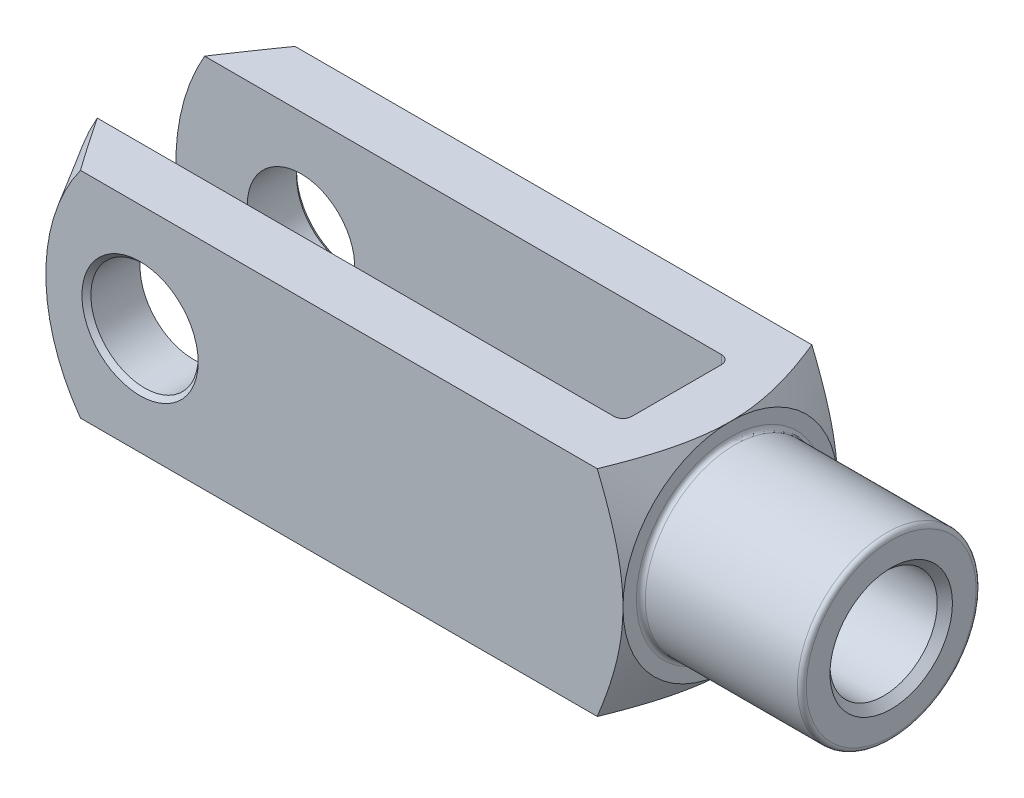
ISO-10303-21;
HEADER;
FILE_DESCRIPTION(('STEP AP214'),'2;1');
FILE_NAME('part.step','',(''),(''),'','','');
FILE_SCHEMA(('AUTOMOTIVE_DESIGN { 1 0 10303 214 1 1 1 1 }'));
ENDSEC;
DATA;
#1=APPLICATION_CONTEXT('core data for automotive mechanical design processes');
#2=APPLICATION_PROTOCOL_DEFINITION('international standard','automotive_design',2000,#1);
#3=PRODUCT_CONTEXT('',#1,'mechanical');
#4=PRODUCT('Part','Part','',(#3));
#5=PRODUCT_RELATED_PRODUCT_CATEGORY('part','',(#4));
#6=PRODUCT_DEFINITION_FORMATION('','',#4);
#7=PRODUCT_DEFINITION_CONTEXT('part definition',#1,'design');
#8=PRODUCT_DEFINITION('design','',#6,#7);
#9=PRODUCT_DEFINITION_SHAPE('','',#8);
#10=(LENGTH_UNIT() NAMED_UNIT(*) SI_UNIT(.MILLI.,.METRE.));
#11=(NAMED_UNIT(*) PLANE_ANGLE_UNIT() SI_UNIT($,.RADIAN.));
#12=(NAMED_UNIT(*) SI_UNIT($,.STERADIAN.) SOLID_ANGLE_UNIT());
#13=UNCERTAINTY_MEASURE_WITH_UNIT(LENGTH_MEASURE(1.E-05),#10,'distance_accuracy_value','');
#14=(GEOMETRIC_REPRESENTATION_CONTEXT(3) GLOBAL_UNCERTAINTY_ASSIGNED_CONTEXT((#13)) GLOBAL_UNIT_ASSIGNED_CONTEXT((#10,
#11,#12)) REPRESENTATION_CONTEXT('',''));
#15=CARTESIAN_POINT('',(0.,0.,0.));
#16=DIRECTION('',(0.,0.,1.));
#17=DIRECTION('',(1.,0.,0.));
#18=AXIS2_PLACEMENT_3D('',#15,#16,#17);
#19=CARTESIAN_POINT('',(-25.,-12.,-4.99999999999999));
#20=DIRECTION('',(0.,-1.,0.));
#21=DIRECTION('',(0.,0.,-1.));
#22=AXIS2_PLACEMENT_3D('',#19,#20,#21);
#23=CYLINDRICAL_SURFACE('',#22,1.);
#24=DIRECTION('',(0.,1.,0.));
#25=VECTOR('',#24,1.);
#26=CARTESIAN_POINT('',(-24.,-12.,-4.99999999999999));
#27=LINE('',#26,#25);
#28=CARTESIAN_POINT('',(-24.,-3.31662479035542,-4.99999999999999));
#29=VERTEX_POINT('',#28);
#30=CARTESIAN_POINT('',(-24.,-12.,-4.99999999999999));
#31=VERTEX_POINT('',#30);
#32=EDGE_CURVE('E357',#29,#31,#27,.F.);
#33=ORIENTED_EDGE('',*,*,#32,.F.);
#34=CARTESIAN_POINT('',(-24.,-3.31662479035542,-4.99999999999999));
#35=CARTESIAN_POINT('',(-24.000039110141,-3.2458892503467,-5.04693073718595));
#36=CARTESIAN_POINT('',(-24.0032998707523,-3.17421071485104,-5.0923055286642));
#37=CARTESIAN_POINT('',(-24.0152871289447,-3.02944292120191,-5.17972843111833));
#38=CARTESIAN_POINT('',(-24.0240049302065,-2.95635608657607,-5.22178171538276));
#39=CARTESIAN_POINT('',(-24.0458771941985,-2.80940810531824,-5.30228419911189));
#40=CARTESIAN_POINT('',(-24.0590080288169,-2.73555307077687,-5.34075122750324));
#41=CARTESIAN_POINT('',(-24.0890023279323,-2.58689159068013,-5.41432119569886));
#42=CARTESIAN_POINT('',(-24.1058679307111,-2.51208462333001,-5.44942219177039));
#43=CARTESIAN_POINT('',(-24.1575747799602,-2.30106419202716,-5.54321172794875));
#44=CARTESIAN_POINT('',(-24.1959404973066,-2.16400188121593,-5.59808248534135));
#45=CARTESIAN_POINT('',(-24.2800168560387,-1.88823561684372,-5.69702137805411));
#46=CARTESIAN_POINT('',(-24.3257315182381,-1.74953080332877,-5.74108356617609));
#47=CARTESIAN_POINT('',(-24.422565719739,-1.47057265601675,-5.81880111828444));
#48=CARTESIAN_POINT('',(-24.4737025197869,-1.33031573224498,-5.85242182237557));
#49=CARTESIAN_POINT('',(-24.579554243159,-1.04914006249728,-5.90930382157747));
#50=CARTESIAN_POINT('',(-24.634267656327,-0.908221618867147,-5.9325694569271));
#51=CARTESIAN_POINT('',(-24.7396434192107,-0.64175617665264,-5.96691885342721));
#52=CARTESIAN_POINT('',(-24.7900743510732,-0.516252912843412,-5.97907412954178));
#53=CARTESIAN_POINT('',(-24.891718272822,-0.265271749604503,-5.99544962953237));
#54=CARTESIAN_POINT('',(-24.9429298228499,-0.139794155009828,-5.99968301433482));
#55=CARTESIAN_POINT('',(-24.9960964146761,-0.00956179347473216,-5.99999428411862));
#56=CARTESIAN_POINT('',(-24.9980482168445,-0.00478087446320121,-5.99999999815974));
#57=CARTESIAN_POINT('',(-25.,0.,-6.));
#58=B_SPLINE_CURVE_WITH_KNOTS('',3,(#34,#35,#36,#37,#38,#39,#40,#41,#42,#43,#44,#45,#46,#47,#48,
#49,#50,#51,#52,#53,#54,#55,#56,#57),.UNSPECIFIED.,.F.,.F.,(4,2,2,2,2,2,2,2,2,2,2,4),(0.,
0.254478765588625,0.508553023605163,0.76128804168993,1.01416813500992,1.47107229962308,
1.92822730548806,2.38688397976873,2.8453482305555,3.25253093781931,3.65903657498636,
3.67452851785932),.UNSPECIFIED.);
#59=CARTESIAN_POINT('',(-25.,0.,-6.));
#60=VERTEX_POINT('',#59);
#61=EDGE_CURVE('E388',#29,#60,#58,.T.);
#62=ORIENTED_EDGE('',*,*,#61,.T.);
#63=DIRECTION('',(0.,1.,0.));
#64=VECTOR('',#63,1.);
#65=CARTESIAN_POINT('',(-25.,12.,-5.99999999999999));
#66=LINE('',#65,#64);
#67=CARTESIAN_POINT('',(-25.,-12.,-5.99999999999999));
#68=VERTEX_POINT('',#67);
#69=EDGE_CURVE('E183',#68,#60,#66,.T.);
#70=ORIENTED_EDGE('',*,*,#69,.F.);
#71=CARTESIAN_POINT('',(-25.,-12.,-4.99999999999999));
#72=DIRECTION('',(0.,-1.,0.));
#73=DIRECTION('',(0.,0.,-1.));
#74=AXIS2_PLACEMENT_3D('',#71,#72,#73);
#75=CIRCLE('',#74,1.);
#76=EDGE_CURVE('E198',#31,#68,#75,.F.);
#77=ORIENTED_EDGE('',*,*,#76,.F.);
#78=EDGE_LOOP('',(#33,#62,#70,#77));
#79=FACE_BOUND('',#78,.T.);
#80=ADVANCED_FACE('F37',(#79),#23,.F.);
#81=CARTESIAN_POINT('',(-24.,-12.,-5.99999999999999));
#82=DIRECTION('',(1.,0.,0.));
#83=DIRECTION('',(0.,0.,-1.));
#84=AXIS2_PLACEMENT_3D('',#81,#82,#83);
#85=PLANE('',#84);
#86=CARTESIAN_POINT('',(-24.,12.,-4.99999999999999));
#87=VERTEX_POINT('',#86);
#88=CARTESIAN_POINT('',(-24.,3.31662479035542,-4.99999999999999));
#89=VERTEX_POINT('',#88);
#90=EDGE_CURVE('E373',#87,#89,#27,.F.);
#91=ORIENTED_EDGE('',*,*,#90,.T.);
#92=CARTESIAN_POINT('',(-24.,0.,0.));
#93=DIRECTION('',(1.,0.,0.));
#94=DIRECTION('',(0.,0.,-1.));
#95=AXIS2_PLACEMENT_3D('',#92,#93,#94);
#96=CIRCLE('',#95,6.);
#97=CARTESIAN_POINT('',(-24.,3.31662479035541,5.));
#98=VERTEX_POINT('',#97);
#99=EDGE_CURVE('E442',#89,#98,#96,.T.);
#100=ORIENTED_EDGE('',*,*,#99,.T.);
#101=DIRECTION('',(0.,1.,0.));
#102=VECTOR('',#101,1.);
#103=CARTESIAN_POINT('',(-24.,12.,5.));
#104=LINE('',#103,#102);
#105=CARTESIAN_POINT('',(-24.,12.,5.));
#106=VERTEX_POINT('',#105);
#107=EDGE_CURVE('E160',#98,#106,#104,.T.);
#108=ORIENTED_EDGE('',*,*,#107,.T.);
#109=DIRECTION('',(0.,0.,-1.));
#110=VECTOR('',#109,1.);
#111=CARTESIAN_POINT('',(-24.,12.,-5.99999999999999));
#112=LINE('',#111,#110);
#113=EDGE_CURVE('E338',#106,#87,#112,.T.);
#114=ORIENTED_EDGE('',*,*,#113,.T.);
#115=EDGE_LOOP('',(#91,#100,#108,#114));
#116=FACE_BOUND('',#115,.T.);
#117=ADVANCED_FACE('F493',(#116),#85,.F.);
#118=CARTESIAN_POINT('',(-25.,-12.,5.));
#119=DIRECTION('',(0.,-1.,0.));
#120=DIRECTION('',(0.,0.,-1.));
#121=AXIS2_PLACEMENT_3D('',#118,#119,#120);
#122=CYLINDRICAL_SURFACE('',#121,1.);
#123=ORIENTED_EDGE('',*,*,#107,.F.);
#124=CARTESIAN_POINT('',(-24.,3.31662479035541,5.));
#125=CARTESIAN_POINT('',(-24.000039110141,3.24588925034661,5.04693073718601));
#126=CARTESIAN_POINT('',(-24.0032998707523,3.17421071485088,5.0923055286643));
#127=CARTESIAN_POINT('',(-24.0152871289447,3.02944292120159,5.17972843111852));
#128=CARTESIAN_POINT('',(-24.0240049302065,2.95635608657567,5.22178171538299));
#129=CARTESIAN_POINT('',(-24.0458771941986,2.80940810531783,5.30228419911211));
#130=CARTESIAN_POINT('',(-24.0590080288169,2.73555307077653,5.34075122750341));
#131=CARTESIAN_POINT('',(-24.0890023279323,2.58689159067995,5.41432119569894));
#132=CARTESIAN_POINT('',(-24.1058679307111,2.51208462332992,5.44942219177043));
#133=CARTESIAN_POINT('',(-24.1575747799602,2.30106419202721,5.54321172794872));
#134=CARTESIAN_POINT('',(-24.1959404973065,2.16400188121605,5.5980824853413));
#135=CARTESIAN_POINT('',(-24.2800168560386,1.88823561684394,5.69702137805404));
#136=CARTESIAN_POINT('',(-24.3257315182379,1.74953080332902,5.741083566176));
#137=CARTESIAN_POINT('',(-24.422565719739,1.47057265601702,5.81880111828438));
#138=CARTESIAN_POINT('',(-24.473702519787,1.33031573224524,5.85242182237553));
#139=CARTESIAN_POINT('',(-24.5795542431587,1.04914006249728,5.90930382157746));
#140=CARTESIAN_POINT('',(-24.6342676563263,0.908221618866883,5.93256945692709));
#141=CARTESIAN_POINT('',(-24.7396434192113,0.64175617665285,5.96691885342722));
#142=CARTESIAN_POINT('',(-24.7900743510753,0.516252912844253,5.97907412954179));
#143=CARTESIAN_POINT('',(-24.8917182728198,0.265271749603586,5.99544962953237));
#144=CARTESIAN_POINT('',(-24.9429298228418,0.139794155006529,5.9996830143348));
#145=CARTESIAN_POINT('',(-24.9960964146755,0.00956179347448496,5.99999428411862));
#146=CARTESIAN_POINT('',(-24.9980482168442,0.00478087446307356,5.99999999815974));
#147=CARTESIAN_POINT('',(-25.,0.,6.));
#148=B_SPLINE_CURVE_WITH_KNOTS('',3,(#124,#125,#126,#127,#128,#129,#130,#131,#132,#133,#134,
#135,#136,#137,#138,#139,#140,#141,#142,#143,#144,#145,#146,#147),.UNSPECIFIED.,.F.,.F.,(4,2,2,
2,2,2,2,2,2,2,2,4),(0.,0.25447876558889,0.508553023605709,0.76128804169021,1.01416813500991,
1.47107229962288,1.92822730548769,2.38688397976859,2.84534823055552,3.25253093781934,
3.65903657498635,3.67452851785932),.UNSPECIFIED.);
#149=CARTESIAN_POINT('',(-25.,0.,6.));
#150=VERTEX_POINT('',#149);
#151=EDGE_CURVE('E145',#98,#150,#148,.T.);
#152=ORIENTED_EDGE('',*,*,#151,.T.);
#153=DIRECTION('',(0.,1.,0.));
#154=VECTOR('',#153,1.);
#155=CARTESIAN_POINT('',(-25.,-12.,6.));
#156=LINE('',#155,#154);
#157=CARTESIAN_POINT('',(-25.,12.,6.));
#158=VERTEX_POINT('',#157);
#159=EDGE_CURVE('E159',#158,#150,#156,.F.);
#160=ORIENTED_EDGE('',*,*,#159,.F.);
#161=CARTESIAN_POINT('',(-25.,12.,5.));
#162=DIRECTION('',(0.,1.,0.));
#163=DIRECTION('',(0.,0.,1.));
#164=AXIS2_PLACEMENT_3D('',#161,#162,#163);
#165=CIRCLE('',#164,1.);
#166=EDGE_CURVE('E190',#106,#158,#165,.F.);
#167=ORIENTED_EDGE('',*,*,#166,.F.);
#168=EDGE_LOOP('',(#123,#152,#160,#167));
#169=FACE_BOUND('',#168,.T.);
#170=ADVANCED_FACE('F156',(#169),#122,.F.);
#171=CARTESIAN_POINT('',(-86.,-12.,-5.99999999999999));
#172=DIRECTION('',(0.,0.,-1.));
#173=DIRECTION('',(-1.,0.,0.));
#174=AXIS2_PLACEMENT_3D('',#171,#172,#173);
#175=PLANE('',#174);
#176=CARTESIAN_POINT('',(-72.,0.,-5.99999999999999));
#177=DIRECTION('',(0.,0.,-1.));
#178=DIRECTION('',(-1.,0.,0.));
#179=AXIS2_PLACEMENT_3D('',#176,#177,#178);
#180=CIRCLE('',#179,6.);
#181=CARTESIAN_POINT('',(-78.,0.,-5.99999999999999));
#182=VERTEX_POINT('',#181);
#183=EDGE_CURVE('E367',#182,#182,#180,.F.);
#184=ORIENTED_EDGE('',*,*,#183,.F.);
#185=EDGE_LOOP('',(#184));
#186=FACE_BOUND('',#185,.T.);
#187=CARTESIAN_POINT('',(-62.,0.,-5.99999999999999));
#188=DIRECTION('',(0.,0.,1.));
#189=DIRECTION('',(1.,0.,0.));
#190=AXIS2_PLACEMENT_3D('',#187,#188,#189);
#191=CIRCLE('',#190,24.);
#192=CARTESIAN_POINT('',(-82.7846096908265,12.,-5.99999999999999));
#193=VERTEX_POINT('',#192);
#194=CARTESIAN_POINT('',(-82.7846096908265,-12.,-5.99999999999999));
#195=VERTEX_POINT('',#194);
#196=EDGE_CURVE('E276',#193,#195,#191,.T.);
#197=ORIENTED_EDGE('',*,*,#196,.T.);
#198=DIRECTION('',(-1.,0.,0.));
#199=VECTOR('',#198,1.);
#200=CARTESIAN_POINT('',(-86.,-12.,-5.99999999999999));
#201=LINE('',#200,#199);
#202=EDGE_CURVE('E333',#68,#195,#201,.T.);
#203=ORIENTED_EDGE('',*,*,#202,.F.);
#204=ORIENTED_EDGE('',*,*,#69,.T.);
#205=CARTESIAN_POINT('',(-25.,12.,-5.99999999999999));
#206=VERTEX_POINT('',#205);
#207=EDGE_CURVE('E179',#60,#206,#66,.T.);
#208=ORIENTED_EDGE('',*,*,#207,.T.);
#209=DIRECTION('',(-1.,0.,0.));
#210=VECTOR('',#209,1.);
#211=CARTESIAN_POINT('',(-86.,12.,-5.99999999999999));
#212=LINE('',#211,#210);
#213=EDGE_CURVE('E345',#206,#193,#212,.T.);
#214=ORIENTED_EDGE('',*,*,#213,.T.);
#215=EDGE_LOOP('',(#197,#203,#204,#208,#214));
#216=FACE_BOUND('',#215,.T.);
#217=ADVANCED_FACE('F391',(#186,#216),#175,.F.);
#218=CARTESIAN_POINT('',(-86.,-12.,6.00000000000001));
#219=DIRECTION('',(0.,0.,1.));
#220=DIRECTION('',(1.,0.,0.));
#221=AXIS2_PLACEMENT_3D('',#218,#219,#220);
#222=PLANE('',#221);
#223=CARTESIAN_POINT('',(-72.,0.,6.00000000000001));
#224=DIRECTION('',(0.,0.,1.));
#225=DIRECTION('',(1.,0.,0.));
#226=AXIS2_PLACEMENT_3D('',#223,#224,#225);
#227=CIRCLE('',#226,6.);
#228=CARTESIAN_POINT('',(-66.,0.,6.00000000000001));
#229=VERTEX_POINT('',#228);
#230=EDGE_CURVE('E344',#229,#229,#227,.F.);
#231=ORIENTED_EDGE('',*,*,#230,.F.);
#232=EDGE_LOOP('',(#231));
#233=FACE_BOUND('',#232,.T.);
#234=DIRECTION('',(1.,0.,0.));
#235=VECTOR('',#234,1.);
#236=CARTESIAN_POINT('',(-86.,-12.,6.00000000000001));
#237=LINE('',#236,#235);
#238=CARTESIAN_POINT('',(-82.7846096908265,-12.,6.00000000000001));
#239=VERTEX_POINT('',#238);
#240=CARTESIAN_POINT('',(-25.,-12.,6.));
#241=VERTEX_POINT('',#240);
#242=EDGE_CURVE('E337',#239,#241,#237,.T.);
#243=ORIENTED_EDGE('',*,*,#242,.F.);
#244=CARTESIAN_POINT('',(-62.,0.,6.00000000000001));
#245=DIRECTION('',(0.,0.,1.));
#246=DIRECTION('',(1.,0.,0.));
#247=AXIS2_PLACEMENT_3D('',#244,#245,#246);
#248=CIRCLE('',#247,24.);
#249=CARTESIAN_POINT('',(-82.7846096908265,12.,6.00000000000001));
#250=VERTEX_POINT('',#249);
#251=EDGE_CURVE('E448',#250,#239,#248,.T.);
#252=ORIENTED_EDGE('',*,*,#251,.F.);
#253=DIRECTION('',(1.,0.,0.));
#254=VECTOR('',#253,1.);
#255=CARTESIAN_POINT('',(-86.,12.,6.00000000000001));
#256=LINE('',#255,#254);
#257=EDGE_CURVE('E176',#250,#158,#256,.T.);
#258=ORIENTED_EDGE('',*,*,#257,.T.);
#259=ORIENTED_EDGE('',*,*,#159,.T.);
#260=EDGE_CURVE('E164',#150,#241,#156,.F.);
#261=ORIENTED_EDGE('',*,*,#260,.T.);
#262=EDGE_LOOP('',(#243,#252,#258,#259,#261));
#263=FACE_BOUND('',#262,.T.);
#264=ADVANCED_FACE('F173',(#233,#263),#222,.F.);
#265=CARTESIAN_POINT('',(-86.,-12.,12.));
#266=DIRECTION('',(0.,0.,1.));
#267=DIRECTION('',(1.,0.,0.));
#268=AXIS2_PLACEMENT_3D('',#265,#266,#267);
#269=PLANE('',#268);
#270=CARTESIAN_POINT('',(-72.,0.,12.));
#271=DIRECTION('',(0.,0.,1.));
#272=DIRECTION('',(1.,0.,0.));
#273=AXIS2_PLACEMENT_3D('',#270,#271,#272);
#274=CIRCLE('',#273,6.50000000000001);
#275=CARTESIAN_POINT('',(-65.5,0.,12.));
#276=VERTEX_POINT('',#275);
#277=EDGE_CURVE('E228',#276,#276,#274,.F.);
#278=ORIENTED_EDGE('',*,*,#277,.T.);
#279=EDGE_LOOP('',(#278));
#280=FACE_BOUND('',#279,.T.);
#281=DIRECTION('',(1.,0.,0.));
#282=VECTOR('',#281,1.);
#283=CARTESIAN_POINT('',(-86.,12.,12.));
#284=LINE('',#283,#282);
#285=CARTESIAN_POINT('',(-78.6650269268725,12.,12.));
#286=VERTEX_POINT('',#285);
#287=CARTESIAN_POINT('',(-20.8697557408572,12.,12.));
#288=VERTEX_POINT('',#287);
#289=EDGE_CURVE('E364',#286,#288,#284,.T.);
#290=ORIENTED_EDGE('',*,*,#289,.F.);
#291=CARTESIAN_POINT('',(-62.,0.,12.));
#292=DIRECTION('',(0.,0.,1.));
#293=DIRECTION('',(1.,0.,0.));
#294=AXIS2_PLACEMENT_3D('',#291,#292,#293);
#295=CIRCLE('',#294,20.5358983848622);
#296=CARTESIAN_POINT('',(-78.6650269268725,-12.,12.));
#297=VERTEX_POINT('',#296);
#298=EDGE_CURVE('E61',#286,#297,#295,.T.);
#299=ORIENTED_EDGE('',*,*,#298,.T.);
#300=DIRECTION('',(1.,0.,0.));
#301=VECTOR('',#300,1.);
#302=CARTESIAN_POINT('',(-86.,-12.,12.));
#303=LINE('',#302,#301);
#304=CARTESIAN_POINT('',(-20.8697557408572,-12.,12.));
#305=VERTEX_POINT('',#304);
#306=EDGE_CURVE('E361',#297,#305,#303,.T.);
#307=ORIENTED_EDGE('',*,*,#306,.T.);
#308=CARTESIAN_POINT('',(-26.8270481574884,-24.508852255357,12.));
#309=CARTESIAN_POINT('',(-26.5204158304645,-23.9174203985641,12.));
#310=CARTESIAN_POINT('',(-26.2154046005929,-23.3251403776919,12.));
#311=CARTESIAN_POINT('',(-25.6094839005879,-22.1384473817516,12.));
#312=CARTESIAN_POINT('',(-25.3085746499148,-21.5440342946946,12.));
#313=CARTESIAN_POINT('',(-24.7112306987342,-20.3516642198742,12.));
#314=CARTESIAN_POINT('',(-24.4148047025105,-19.753702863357,12.));
#315=CARTESIAN_POINT('',(-23.8281918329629,-18.5547362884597,12.));
#316=CARTESIAN_POINT('',(-23.5380048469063,-17.9537311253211,12.));
#317=CARTESIAN_POINT('',(-22.9478447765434,-16.7109015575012,12.));
#318=CARTESIAN_POINT('',(-22.6483679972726,-16.0688406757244,12.));
#319=CARTESIAN_POINT('',(-22.0608191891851,-14.7794664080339,12.));
#320=CARTESIAN_POINT('',(-21.7727477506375,-14.132152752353,12.));
#321=CARTESIAN_POINT('',(-21.211729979,-12.8312921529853,12.));
#322=CARTESIAN_POINT('',(-20.9387769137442,-12.177748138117,12.));
#323=CARTESIAN_POINT('',(-20.5444276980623,-11.1914316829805,12.));
#324=CARTESIAN_POINT('',(-20.4154954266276,-10.8616706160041,12.));
#325=CARTESIAN_POINT('',(-20.1634870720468,-10.1999223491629,12.));
#326=CARTESIAN_POINT('',(-20.0404108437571,-9.867935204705,12.));
#327=CARTESIAN_POINT('',(-19.7750973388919,-9.12924658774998,12.));
#328=CARTESIAN_POINT('',(-19.6344928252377,-8.72195527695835,12.));
#329=CARTESIAN_POINT('',(-19.3653837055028,-7.90341175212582,12.));
#330=CARTESIAN_POINT('',(-19.2368780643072,-7.4921598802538,12.));
#331=CARTESIAN_POINT('',(-18.99435151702,-6.66538582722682,12.));
#332=CARTESIAN_POINT('',(-18.8803303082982,-6.24986373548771,12.));
#333=CARTESIAN_POINT('',(-18.6694959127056,-5.41444148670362,12.));
#334=CARTESIAN_POINT('',(-18.5726825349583,-4.99454137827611,12.));
#335=CARTESIAN_POINT('',(-18.4012191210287,-4.16046851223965,12.));
#336=CARTESIAN_POINT('',(-18.3261021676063,-3.74639268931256,12.));
#337=CARTESIAN_POINT('',(-18.1977094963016,-2.91483992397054,12.));
#338=CARTESIAN_POINT('',(-18.1444330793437,-2.49736309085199,12.));
#339=CARTESIAN_POINT('',(-18.061948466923,-1.66028284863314,12.));
#340=CARTESIAN_POINT('',(-18.032724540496,-1.24068101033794,12.));
#341=CARTESIAN_POINT('',(-17.9996341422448,-0.400474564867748,12.));
#342=CARTESIAN_POINT('',(-17.9957667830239,0.0201300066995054,12.));
#343=CARTESIAN_POINT('',(-18.0129154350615,0.830148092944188,12.));
#344=CARTESIAN_POINT('',(-18.0321388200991,1.2196011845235,12.));
#345=CARTESIAN_POINT('',(-18.091746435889,1.99686728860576,12.));
#346=CARTESIAN_POINT('',(-18.1321306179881,2.38468030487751,12.));
#347=CARTESIAN_POINT('',(-18.232579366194,3.15792367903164,12.));
#348=CARTESIAN_POINT('',(-18.2926540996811,3.54335270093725,12.));
#349=CARTESIAN_POINT('',(-18.4305032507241,4.31101186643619,12.));
#350=CARTESIAN_POINT('',(-18.5082781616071,4.69324192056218,12.));
#351=CARTESIAN_POINT('',(-18.6818401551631,5.46519444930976,12.));
#352=CARTESIAN_POINT('',(-18.7780834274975,5.85481356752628,12.));
#353=CARTESIAN_POINT('',(-18.9846981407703,6.63026168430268,12.));
#354=CARTESIAN_POINT('',(-19.0950697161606,7.01609064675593,12.));
#355=CARTESIAN_POINT('',(-19.327805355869,7.78407900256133,12.));
#356=CARTESIAN_POINT('',(-19.450168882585,8.16623855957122,12.));
#357=CARTESIAN_POINT('',(-19.6413066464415,8.73690278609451,12.));
#358=CARTESIAN_POINT('',(-19.706283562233,8.92669203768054,12.));
#359=CARTESIAN_POINT('',(-19.8385670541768,9.30545658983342,12.));
#360=CARTESIAN_POINT('',(-19.9058736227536,9.49443189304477,12.));
#361=CARTESIAN_POINT('',(-20.1221378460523,10.09093133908,12.));
#362=CARTESIAN_POINT('',(-20.2750221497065,10.4970351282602,12.));
#363=CARTESIAN_POINT('',(-20.5890916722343,11.3060297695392,12.));
#364=CARTESIAN_POINT('',(-20.750277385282,11.7089204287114,12.));
#365=CARTESIAN_POINT('',(-21.0796092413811,12.5119467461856,12.));
#366=CARTESIAN_POINT('',(-21.2477569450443,12.9120817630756,12.));
#367=CARTESIAN_POINT('',(-21.5898549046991,13.7098486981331,12.));
#368=CARTESIAN_POINT('',(-21.7638050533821,14.1074806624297,12.));
#369=CARTESIAN_POINT('',(-22.1167497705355,14.900905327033,12.));
#370=CARTESIAN_POINT('',(-22.2957485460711,15.296696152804,12.));
#371=CARTESIAN_POINT('',(-22.6579079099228,16.0863711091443,12.));
#372=CARTESIAN_POINT('',(-22.841068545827,16.4802552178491,12.));
#373=CARTESIAN_POINT('',(-23.3958010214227,17.6593177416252,12.));
#374=CARTESIAN_POINT('',(-23.7726679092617,18.4420054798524,12.));
#375=CARTESIAN_POINT('',(-24.5379796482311,20.004634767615,12.));
#376=CARTESIAN_POINT('',(-24.9264562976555,20.7845606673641,12.));
#377=CARTESIAN_POINT('',(-25.7113669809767,22.3404133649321,12.));
#378=CARTESIAN_POINT('',(-26.107801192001,23.1163400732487,12.));
#379=CARTESIAN_POINT('',(-26.9066094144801,24.6646398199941,12.));
#380=CARTESIAN_POINT('',(-27.3089803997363,25.4370144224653,12.));
#381=CARTESIAN_POINT('',(-28.1185505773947,26.9792185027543,12.));
#382=CARTESIAN_POINT('',(-28.5257497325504,27.7490480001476,12.));
#383=CARTESIAN_POINT('',(-29.6315922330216,29.8271201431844,12.));
#384=CARTESIAN_POINT('',(-30.3338843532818,31.1334202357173,12.));
#385=CARTESIAN_POINT('',(-31.7463886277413,33.7419610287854,12.));
#386=CARTESIAN_POINT('',(-32.4566018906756,35.0442011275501,12.));
#387=CARTESIAN_POINT('',(-33.8786764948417,37.6380871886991,12.));
#388=CARTESIAN_POINT('',(-34.5905050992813,38.9297511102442,12.));
#389=CARTESIAN_POINT('',(-35.6613936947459,40.865371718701,12.));
#390=CARTESIAN_POINT('',(-36.0188525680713,41.5102153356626,12.));
#391=CARTESIAN_POINT('',(-36.7347123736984,42.7993785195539,12.));
#392=CARTESIAN_POINT('',(-37.0931133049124,43.4436980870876,12.));
#393=CARTESIAN_POINT('',(-37.4519232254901,44.0877898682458,12.));
#394=B_SPLINE_CURVE_WITH_KNOTS('',3,(#308,#309,#310,#311,#312,#313,#314,#315,#316,#317,#318,
#319,#320,#321,#322,#323,#324,#325,#326,#327,#328,#329,#330,#331,#332,#333,#334,#335,#336,#337,
#338,#339,#340,#341,#342,#343,#344,#345,#346,#347,#348,#349,#350,#351,#352,#353,#354,#355,#356,
#357,#358,#359,#360,#361,#362,#363,#364,#365,#366,#367,#368,#369,#370,#371,#372,#373,#374,#375,
#376,#377,#378,#379,#380,#381,#382,#383,#384,#385,#386,#387,#388,#389,#390,#391,#392,#393),
.UNSPECIFIED.,.F.,.F.,(4,2,2,2,2,2,2,2,2,2,2,2,2,2,2,2,2,2,2,2,2,2,2,2,2,2,2,2,2,2,2,2,2,2,2,2,
2,2,2,2,2,2,4),(0.,1.99859095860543,3.99728842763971,5.99946635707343,8.00160807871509,
10.1269271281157,12.2523560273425,14.3768307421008,15.4389968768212,16.501136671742,
17.793611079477,19.0859748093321,20.3783115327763,21.6706339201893,22.9326201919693,
24.194566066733,25.4556859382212,26.7167616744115,27.8859474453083,29.0551305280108,
30.2249182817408,31.3947386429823,32.5984184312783,33.8021096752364,35.0057469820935,
35.6075466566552,36.209344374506,37.51100701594,38.8127472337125,40.1147808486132,
41.4167903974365,42.719918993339,44.0230624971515,46.6290236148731,49.2429304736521,
51.8568955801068,54.469571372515,57.082227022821,61.5315331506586,65.9814700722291,
70.4059202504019,72.6177970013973,74.829671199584),.UNSPECIFIED.);
#395=CARTESIAN_POINT('',(-18.,0.,12.));
#396=VERTEX_POINT('',#395);
#397=EDGE_CURVE('E305',#396,#305,#394,.F.);
#398=ORIENTED_EDGE('',*,*,#397,.F.);
#399=EDGE_CURVE('E303',#288,#396,#394,.F.);
#400=ORIENTED_EDGE('',*,*,#399,.F.);
#401=EDGE_LOOP('',(#290,#299,#307,#398,#400));
#402=FACE_BOUND('',#401,.T.);
#403=ADVANCED_FACE('F287',(#280,#402),#269,.T.);
#404=CARTESIAN_POINT('',(-86.,-12.,12.));
#405=DIRECTION('',(0.,-1.,0.));
#406=DIRECTION('',(0.,0.,-1.));
#407=AXIS2_PLACEMENT_3D('',#404,#405,#406);
#408=PLANE('',#407);
#409=ORIENTED_EDGE('',*,*,#202,.T.);
#410=CARTESIAN_POINT('',(-92.2786029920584,-12.,8.84338025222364));
#411=CARTESIAN_POINT('',(-91.6947368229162,-12.,7.90330325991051));
#412=CARTESIAN_POINT('',(-91.1092717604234,-12.,6.96421474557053));
#413=CARTESIAN_POINT('',(-89.9343954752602,-12.,5.08848378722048));
#414=CARTESIAN_POINT('',(-89.3449841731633,-12.,4.15184139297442));
#415=CARTESIAN_POINT('',(-88.1607841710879,-12.,2.28039346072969));
#416=CARTESIAN_POINT('',(-87.565989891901,-12.,1.34559145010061));
#417=CARTESIAN_POINT('',(-86.3707199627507,-12.,-0.520365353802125));
#418=CARTESIAN_POINT('',(-85.7702443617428,-12.,-1.4515201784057));
#419=CARTESIAN_POINT('',(-84.5371594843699,-12.,-3.34796497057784));
#420=CARTESIAN_POINT('',(-83.9042532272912,-12.,-4.3130620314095));
#421=CARTESIAN_POINT('',(-82.6288928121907,-12.,-6.2369287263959));
#422=CARTESIAN_POINT('',(-81.9864387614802,-12.,-7.19569843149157));
#423=CARTESIAN_POINT('',(-81.0137395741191,-12.,-8.62721356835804));
#424=CARTESIAN_POINT('',(-80.6881242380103,-12.,-9.10310585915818));
#425=CARTESIAN_POINT('',(-80.0333476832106,-12.,-10.0524433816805));
#426=CARTESIAN_POINT('',(-79.7041864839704,-12.,-10.5258886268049));
#427=CARTESIAN_POINT('',(-79.0417887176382,-12.,-11.4698924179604));
#428=CARTESIAN_POINT('',(-78.7085523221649,-12.,-11.9404510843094));
#429=CARTESIAN_POINT('',(-78.0373266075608,-12.,-12.8781628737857));
#430=CARTESIAN_POINT('',(-77.6993373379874,-12.,-13.3453160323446));
#431=CARTESIAN_POINT('',(-77.0209560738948,-12.,-14.271205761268));
#432=CARTESIAN_POINT('',(-76.6806158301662,-12.,-14.7299801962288));
#433=CARTESIAN_POINT('',(-75.9934550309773,-12.,-15.6426726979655));
#434=CARTESIAN_POINT('',(-75.6466343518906,-12.,-16.096590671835));
#435=CARTESIAN_POINT('',(-74.9447774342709,-12.,-16.9990439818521));
#436=CARTESIAN_POINT('',(-74.5897305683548,-12.,-17.4475710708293));
#437=CARTESIAN_POINT('',(-73.8702804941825,-12.,-18.3370436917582));
#438=CARTESIAN_POINT('',(-73.5058777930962,-12.,-18.7779896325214));
#439=CARTESIAN_POINT('',(-72.7694365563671,-12.,-19.6456462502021));
#440=CARTESIAN_POINT('',(-72.3975164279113,-12.,-20.0724571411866));
#441=CARTESIAN_POINT('',(-71.6396530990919,-12.,-20.9137472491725));
#442=CARTESIAN_POINT('',(-71.2537063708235,-12.,-21.3282233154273));
#443=CARTESIAN_POINT('',(-70.6621255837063,-12.,-21.9367708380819));
#444=CARTESIAN_POINT('',(-70.4630426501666,-12.,-22.1372171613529));
#445=CARTESIAN_POINT('',(-70.0599745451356,-12.,-22.5331099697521));
#446=CARTESIAN_POINT('',(-69.855989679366,-12.,-22.7285567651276));
#447=CARTESIAN_POINT('',(-69.4425971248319,-12.,-23.1134290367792));
#448=CARTESIAN_POINT('',(-69.2331922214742,-12.,-23.3028574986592));
#449=CARTESIAN_POINT('',(-68.8081788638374,-12.,-23.6745980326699));
#450=CARTESIAN_POINT('',(-68.5925713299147,-12.,-23.8569111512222));
#451=CARTESIAN_POINT('',(-68.2600203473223,-12.,-24.127088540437));
#452=CARTESIAN_POINT('',(-68.1456331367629,-12.,-24.2181054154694));
#453=CARTESIAN_POINT('',(-67.9148670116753,-12.,-24.3975755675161));
#454=CARTESIAN_POINT('',(-67.7984881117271,-12.,-24.486028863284));
#455=CARTESIAN_POINT('',(-67.446141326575,-12.,-24.7471697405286));
#456=CARTESIAN_POINT('',(-67.2069947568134,-12.,-24.9156125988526));
#457=CARTESIAN_POINT('',(-66.7195001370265,-12.,-25.2383188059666));
#458=CARTESIAN_POINT('',(-66.4711595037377,-12.,-25.3925932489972));
#459=CARTESIAN_POINT('',(-65.964514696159,-12.,-25.6835963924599));
#460=CARTESIAN_POINT('',(-65.7062131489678,-12.,-25.8203296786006));
#461=CARTESIAN_POINT('',(-65.0356348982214,-12.,-26.1405466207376));
#462=CARTESIAN_POINT('',(-64.6158504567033,-12.,-26.3091476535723));
#463=CARTESIAN_POINT('',(-63.9703142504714,-12.,-26.5095003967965));
#464=CARTESIAN_POINT('',(-63.7525810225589,-12.,-26.5675140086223));
#465=CARTESIAN_POINT('',(-63.3127569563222,-12.,-26.6640173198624));
#466=CARTESIAN_POINT('',(-63.0906663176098,-12.,-26.702507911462));
#467=CARTESIAN_POINT('',(-62.641579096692,-12.,-26.7585747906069));
#468=CARTESIAN_POINT('',(-62.4145556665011,-12.,-26.7759381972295));
#469=CARTESIAN_POINT('',(-61.9599023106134,-12.,-26.7882217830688));
#470=CARTESIAN_POINT('',(-61.7322724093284,-12.,-26.7831428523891));
#471=CARTESIAN_POINT('',(-61.2785688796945,-12.,-26.7507852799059));
#472=CARTESIAN_POINT('',(-61.0524955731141,-12.,-26.7235021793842));
#473=CARTESIAN_POINT('',(-60.6038899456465,-12.,-26.6479928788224));
#474=CARTESIAN_POINT('',(-60.3813581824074,-12.,-26.5997634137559));
#475=CARTESIAN_POINT('',(-59.9005519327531,-12.,-26.4736338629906));
#476=CARTESIAN_POINT('',(-59.64328906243,-12.,-26.3918933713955));
#477=CARTESIAN_POINT('',(-59.137130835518,-12.,-26.2055998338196));
#478=CARTESIAN_POINT('',(-58.8882402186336,-12.,-26.1010341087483));
#479=CARTESIAN_POINT('',(-58.3986617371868,-12.,-25.8726383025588));
#480=CARTESIAN_POINT('',(-58.157999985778,-12.,-25.748752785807));
#481=CARTESIAN_POINT('',(-57.6854799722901,-12.,-25.485398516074));
#482=CARTESIAN_POINT('',(-57.453620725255,-12.,-25.3459315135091));
#483=CARTESIAN_POINT('',(-56.9233788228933,-12.,-25.0064399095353));
#484=CARTESIAN_POINT('',(-56.6281184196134,-12.,-24.8015559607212));
#485=CARTESIAN_POINT('',(-56.0502738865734,-12.,-24.3745460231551));
#486=CARTESIAN_POINT('',(-55.7676958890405,-12.,-24.1524118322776));
#487=CARTESIAN_POINT('',(-55.2130794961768,-12.,-23.6943719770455));
#488=CARTESIAN_POINT('',(-54.9410624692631,-12.,-23.4584405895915));
#489=CARTESIAN_POINT('',(-54.406626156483,-12.,-22.9760898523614));
#490=CARTESIAN_POINT('',(-54.1442052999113,-12.,-22.7296722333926));
#491=CARTESIAN_POINT('',(-53.6258300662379,-12.,-22.2267453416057));
#492=CARTESIAN_POINT('',(-53.3699307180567,-12.,-21.970179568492));
#493=CARTESIAN_POINT('',(-52.8652654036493,-12.,-21.4501311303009));
#494=CARTESIAN_POINT('',(-52.616499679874,-12.,-21.1866482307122));
#495=CARTESIAN_POINT('',(-52.1253910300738,-12.,-20.6542828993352));
#496=CARTESIAN_POINT('',(-51.8830417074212,-12.,-20.3854063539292));
#497=CARTESIAN_POINT('',(-51.4036952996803,-12.,-19.8429441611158));
#498=CARTESIAN_POINT('',(-51.1666981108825,-12.,-19.5693586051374));
#499=CARTESIAN_POINT('',(-50.6001496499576,-12.,-18.904067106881));
#500=CARTESIAN_POINT('',(-50.2729278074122,-12.,-18.5103784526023));
#501=CARTESIAN_POINT('',(-49.6261860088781,-12.,-17.7166170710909));
#502=CARTESIAN_POINT('',(-49.3066675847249,-12.,-17.3165430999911));
#503=CARTESIAN_POINT('',(-48.679005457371,-12.,-16.5174455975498));
#504=CARTESIAN_POINT('',(-48.3707624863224,-12.,-16.118499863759));
#505=CARTESIAN_POINT('',(-47.7597996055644,-12.,-15.316589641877));
#506=CARTESIAN_POINT('',(-47.457078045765,-12.,-14.9136264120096));
#507=CARTESIAN_POINT('',(-47.1566197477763,-12.,-14.5090044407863));
#508=B_SPLINE_CURVE_WITH_KNOTS('',3,(#410,#411,#412,#413,#414,#415,#416,#417,#418,#419,#420,
#421,#422,#423,#424,#425,#426,#427,#428,#429,#430,#431,#432,#433,#434,#435,#436,#437,#438,#439,
#440,#441,#442,#443,#444,#445,#446,#447,#448,#449,#450,#451,#452,#453,#454,#455,#456,#457,#458,
#459,#460,#461,#462,#463,#464,#465,#466,#467,#468,#469,#470,#471,#472,#473,#474,#475,#476,#477,
#478,#479,#480,#481,#482,#483,#484,#485,#486,#487,#488,#489,#490,#491,#492,#493,#494,#495,#496,
#497,#498,#499,#500,#501,#502,#503,#504,#505,#506,#507),.UNSPECIFIED.,.F.,.F.,(4,2,2,2,2,2,2,2,
2,2,2,2,2,2,2,2,2,2,2,2,2,2,2,2,2,2,2,2,2,2,2,2,2,2,2,2,2,2,2,2,2,2,2,2,2,2,2,2,4),(0.,
3.31991386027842,6.63989474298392,9.96383874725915,13.2877541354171,16.7500600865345,
20.2123271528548,21.9421957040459,23.6720547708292,25.4018412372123,27.1316096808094,
28.8452569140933,30.5589368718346,32.2749700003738,33.9909103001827,35.6890521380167,
37.3876240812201,38.2350900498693,39.0825033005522,39.9294893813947,40.7763504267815,
41.2148575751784,41.6533615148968,42.5304910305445,43.4069277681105,44.2831349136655,
45.6347123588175,46.3099700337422,46.9851968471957,47.6671724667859,48.3491210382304,
49.031206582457,49.7133984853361,50.5219110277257,51.3308738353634,52.1422020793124,
52.9534392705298,54.0307393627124,55.1085548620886,56.1884481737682,57.2681639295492,
58.3551054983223,59.4420839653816,60.5279345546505,61.613764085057,63.1494038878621,
64.6853465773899,66.1977597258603,67.7097132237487),.UNSPECIFIED.);
#509=CARTESIAN_POINT('',(-78.6650269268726,-12.,-12.));
#510=VERTEX_POINT('',#509);
#511=EDGE_CURVE('E275',#195,#510,#508,.T.);
#512=ORIENTED_EDGE('',*,*,#511,.T.);
#513=DIRECTION('',(1.,0.,0.));
#514=VECTOR('',#513,1.);
#515=CARTESIAN_POINT('',(-86.,-12.,-12.));
#516=LINE('',#515,#514);
#517=CARTESIAN_POINT('',(-20.8697557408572,-12.,-12.));
#518=VERTEX_POINT('',#517);
#519=EDGE_CURVE('E358',#510,#518,#516,.T.);
#520=ORIENTED_EDGE('',*,*,#519,.T.);
#521=CARTESIAN_POINT('',(-26.8270481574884,-12.,-24.508852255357));
#522=CARTESIAN_POINT('',(-26.5204158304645,-12.,-23.9174203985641));
#523=CARTESIAN_POINT('',(-26.2154046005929,-12.,-23.3251403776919));
#524=CARTESIAN_POINT('',(-25.6094839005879,-12.,-22.1384473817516));
#525=CARTESIAN_POINT('',(-25.3085746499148,-12.,-21.5440342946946));
#526=CARTESIAN_POINT('',(-24.7112306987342,-12.,-20.3516642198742));
#527=CARTESIAN_POINT('',(-24.4148047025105,-12.,-19.753702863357));
#528=CARTESIAN_POINT('',(-23.8281918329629,-12.,-18.5547362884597));
#529=CARTESIAN_POINT('',(-23.5380048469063,-12.,-17.9537311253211));
#530=CARTESIAN_POINT('',(-22.9478447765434,-12.,-16.7109015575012));
#531=CARTESIAN_POINT('',(-22.6483679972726,-12.,-16.0688406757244));
#532=CARTESIAN_POINT('',(-22.0608191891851,-12.,-14.7794664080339));
#533=CARTESIAN_POINT('',(-21.7727477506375,-12.,-14.132152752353));
#534=CARTESIAN_POINT('',(-21.211729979,-12.,-12.8312921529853));
#535=CARTESIAN_POINT('',(-20.9387769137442,-12.,-12.177748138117));
#536=CARTESIAN_POINT('',(-20.5444276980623,-12.,-11.1914316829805));
#537=CARTESIAN_POINT('',(-20.4154954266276,-12.,-10.8616706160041));
#538=CARTESIAN_POINT('',(-20.1634870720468,-12.,-10.1999223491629));
#539=CARTESIAN_POINT('',(-20.0404108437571,-12.,-9.867935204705));
#540=CARTESIAN_POINT('',(-19.7750973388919,-12.,-9.12924658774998));
#541=CARTESIAN_POINT('',(-19.6344928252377,-12.,-8.72195527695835));
#542=CARTESIAN_POINT('',(-19.3653837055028,-12.,-7.90341175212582));
#543=CARTESIAN_POINT('',(-19.2368780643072,-12.,-7.4921598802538));
#544=CARTESIAN_POINT('',(-18.99435151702,-12.,-6.66538582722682));
#545=CARTESIAN_POINT('',(-18.8803303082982,-12.,-6.24986373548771));
#546=CARTESIAN_POINT('',(-18.6694959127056,-12.,-5.41444148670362));
#547=CARTESIAN_POINT('',(-18.5726825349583,-12.,-4.99454137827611));
#548=CARTESIAN_POINT('',(-18.4012191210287,-12.,-4.16046851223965));
#549=CARTESIAN_POINT('',(-18.3261021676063,-12.,-3.74639268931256));
#550=CARTESIAN_POINT('',(-18.1977094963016,-12.,-2.91483992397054));
#551=CARTESIAN_POINT('',(-18.1444330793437,-12.,-2.49736309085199));
#552=CARTESIAN_POINT('',(-18.061948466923,-12.,-1.66028284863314));
#553=CARTESIAN_POINT('',(-18.032724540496,-12.,-1.24068101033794));
#554=CARTESIAN_POINT('',(-17.9996341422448,-12.,-0.400474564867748));
#555=CARTESIAN_POINT('',(-17.9957667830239,-12.,0.0201300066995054));
#556=CARTESIAN_POINT('',(-18.0129154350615,-12.,0.830148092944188));
#557=CARTESIAN_POINT('',(-18.0321388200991,-12.,1.2196011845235));
#558=CARTESIAN_POINT('',(-18.091746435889,-12.,1.99686728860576));
#559=CARTESIAN_POINT('',(-18.1321306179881,-12.,2.38468030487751));
#560=CARTESIAN_POINT('',(-18.232579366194,-12.,3.15792367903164));
#561=CARTESIAN_POINT('',(-18.2926540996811,-12.,3.54335270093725));
#562=CARTESIAN_POINT('',(-18.4305032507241,-12.,4.31101186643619));
#563=CARTESIAN_POINT('',(-18.5082781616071,-12.,4.69324192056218));
#564=CARTESIAN_POINT('',(-18.6818401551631,-12.,5.46519444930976));
#565=CARTESIAN_POINT('',(-18.7780834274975,-12.,5.85481356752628));
#566=CARTESIAN_POINT('',(-18.9846981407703,-12.,6.63026168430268));
#567=CARTESIAN_POINT('',(-19.0950697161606,-12.,7.01609064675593));
#568=CARTESIAN_POINT('',(-19.327805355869,-12.,7.78407900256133));
#569=CARTESIAN_POINT('',(-19.450168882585,-12.,8.16623855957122));
#570=CARTESIAN_POINT('',(-19.6413066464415,-12.,8.73690278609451));
#571=CARTESIAN_POINT('',(-19.706283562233,-12.,8.92669203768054));
#572=CARTESIAN_POINT('',(-19.8385670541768,-12.,9.30545658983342));
#573=CARTESIAN_POINT('',(-19.9058736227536,-12.,9.49443189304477));
#574=CARTESIAN_POINT('',(-20.1221378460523,-12.,10.09093133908));
#575=CARTESIAN_POINT('',(-20.2750221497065,-12.,10.4970351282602));
#576=CARTESIAN_POINT('',(-20.5890916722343,-12.,11.3060297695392));
#577=CARTESIAN_POINT('',(-20.750277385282,-12.,11.7089204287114));
#578=CARTESIAN_POINT('',(-21.0796092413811,-12.,12.5119467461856));
#579=CARTESIAN_POINT('',(-21.2477569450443,-12.,12.9120817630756));
#580=CARTESIAN_POINT('',(-21.5898549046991,-12.,13.7098486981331));
#581=CARTESIAN_POINT('',(-21.7638050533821,-12.,14.1074806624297));
#582=CARTESIAN_POINT('',(-22.1167497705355,-12.,14.900905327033));
#583=CARTESIAN_POINT('',(-22.2957485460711,-12.,15.296696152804));
#584=CARTESIAN_POINT('',(-22.6579079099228,-12.,16.0863711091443));
#585=CARTESIAN_POINT('',(-22.841068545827,-12.,16.4802552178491));
#586=CARTESIAN_POINT('',(-23.3958010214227,-12.,17.6593177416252));
#587=CARTESIAN_POINT('',(-23.7726679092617,-12.,18.4420054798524));
#588=CARTESIAN_POINT('',(-24.5379796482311,-12.,20.004634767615));
#589=CARTESIAN_POINT('',(-24.9264562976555,-12.,20.7845606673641));
#590=CARTESIAN_POINT('',(-25.7113669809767,-12.,22.3404133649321));
#591=CARTESIAN_POINT('',(-26.107801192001,-12.,23.1163400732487));
#592=CARTESIAN_POINT('',(-26.9066094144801,-12.,24.6646398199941));
#593=CARTESIAN_POINT('',(-27.3089803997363,-12.,25.4370144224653));
#594=CARTESIAN_POINT('',(-28.1185505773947,-12.,26.9792185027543));
#595=CARTESIAN_POINT('',(-28.5257497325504,-12.,27.7490480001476));
#596=CARTESIAN_POINT('',(-29.6315922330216,-12.,29.8271201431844));
#597=CARTESIAN_POINT('',(-30.3338843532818,-12.,31.1334202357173));
#598=CARTESIAN_POINT('',(-31.7463886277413,-12.,33.7419610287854));
#599=CARTESIAN_POINT('',(-32.4566018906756,-12.,35.0442011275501));
#600=CARTESIAN_POINT('',(-33.8786764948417,-12.,37.6380871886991));
#601=CARTESIAN_POINT('',(-34.5905050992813,-12.,38.9297511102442));
#602=CARTESIAN_POINT('',(-35.6613936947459,-12.,40.865371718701));
#603=CARTESIAN_POINT('',(-36.0188525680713,-12.,41.5102153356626));
#604=CARTESIAN_POINT('',(-36.7347123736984,-12.,42.7993785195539));
#605=CARTESIAN_POINT('',(-37.0931133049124,-12.,43.4436980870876));
#606=CARTESIAN_POINT('',(-37.4519232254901,-12.,44.0877898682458));
#607=B_SPLINE_CURVE_WITH_KNOTS('',3,(#521,#522,#523,#524,#525,#526,#527,#528,#529,#530,#531,
#532,#533,#534,#535,#536,#537,#538,#539,#540,#541,#542,#543,#544,#545,#546,#547,#548,#549,#550,
#551,#552,#553,#554,#555,#556,#557,#558,#559,#560,#561,#562,#563,#564,#565,#566,#567,#568,#569,
#570,#571,#572,#573,#574,#575,#576,#577,#578,#579,#580,#581,#582,#583,#584,#585,#586,#587,#588,
#589,#590,#591,#592,#593,#594,#595,#596,#597,#598,#599,#600,#601,#602,#603,#604,#605,#606),
.UNSPECIFIED.,.F.,.F.,(4,2,2,2,2,2,2,2,2,2,2,2,2,2,2,2,2,2,2,2,2,2,2,2,2,2,2,2,2,2,2,2,2,2,2,2,
2,2,2,2,2,2,4),(0.,1.99859095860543,3.99728842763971,5.99946635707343,8.00160807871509,
10.1269271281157,12.2523560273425,14.3768307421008,15.4389968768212,16.501136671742,
17.793611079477,19.0859748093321,20.3783115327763,21.6706339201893,22.9326201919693,
24.194566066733,25.4556859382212,26.7167616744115,27.8859474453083,29.0551305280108,
30.2249182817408,31.3947386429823,32.5984184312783,33.8021096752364,35.0057469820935,
35.6075466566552,36.209344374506,37.51100701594,38.8127472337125,40.1147808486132,
41.4167903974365,42.719918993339,44.0230624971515,46.6290236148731,49.2429304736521,
51.8568955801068,54.469571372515,57.082227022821,61.5315331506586,65.9814700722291,
70.4059202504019,72.6177970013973,74.829671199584),.UNSPECIFIED.);
#608=CARTESIAN_POINT('',(-18.,-12.,0.));
#609=VERTEX_POINT('',#608);
#610=EDGE_CURVE('E304',#609,#518,#607,.F.);
#611=ORIENTED_EDGE('',*,*,#610,.F.);
#612=EDGE_CURVE('E295',#305,#609,#607,.F.);
#613=ORIENTED_EDGE('',*,*,#612,.F.);
#614=ORIENTED_EDGE('',*,*,#306,.F.);
#615=CARTESIAN_POINT('',(-47.1566197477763,-12.,14.5090044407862));
#616=CARTESIAN_POINT('',(-47.4006935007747,-12.,14.8377253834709));
#617=CARTESIAN_POINT('',(-47.646275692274,-12.,15.1653349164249));
#618=CARTESIAN_POINT('',(-48.1409326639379,-12.,15.8179416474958));
#619=CARTESIAN_POINT('',(-48.3900076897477,-12.,16.142938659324));
#620=CARTESIAN_POINT('',(-48.8925369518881,-12.,16.7904580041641));
#621=CARTESIAN_POINT('',(-49.1459981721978,-12.,17.1129749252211));
#622=CARTESIAN_POINT('',(-49.6574352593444,-12.,17.7544019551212));
#623=CARTESIAN_POINT('',(-49.9154110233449,-12.,18.0733121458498));
#624=CARTESIAN_POINT('',(-50.439130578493,-12.,18.7099803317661));
#625=CARTESIAN_POINT('',(-50.7049258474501,-12.,19.0276960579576));
#626=CARTESIAN_POINT('',(-51.2426663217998,-12.,19.6578767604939));
#627=CARTESIAN_POINT('',(-51.5146113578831,-12.,19.9703418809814));
#628=CARTESIAN_POINT('',(-52.0655161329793,-12.,20.5886723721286));
#629=CARTESIAN_POINT('',(-52.3444711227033,-12.,20.8945419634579));
#630=CARTESIAN_POINT('',(-52.9108142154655,-12.,21.4983473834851));
#631=CARTESIAN_POINT('',(-53.1982014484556,-12.,21.7962840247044));
#632=CARTESIAN_POINT('',(-53.7368573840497,-12.,22.3359554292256));
#633=CARTESIAN_POINT('',(-53.9866698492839,-12.,22.5791402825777));
#634=CARTESIAN_POINT('',(-54.4945610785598,-12.,23.0568078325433));
#635=CARTESIAN_POINT('',(-54.7526406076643,-12.,23.2912897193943));
#636=CARTESIAN_POINT('',(-55.2785039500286,-12.,23.7494696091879));
#637=CARTESIAN_POINT('',(-55.5462931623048,-12.,23.9731614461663));
#638=CARTESIAN_POINT('',(-56.092915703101,-12.,24.4066687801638));
#639=CARTESIAN_POINT('',(-56.3717476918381,-12.,24.6164859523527));
#640=CARTESIAN_POINT('',(-56.9019016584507,-12.,24.9899890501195));
#641=CARTESIAN_POINT('',(-57.1515693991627,-12.,25.156010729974));
#642=CARTESIAN_POINT('',(-57.6612415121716,-12.,25.4716054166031));
#643=CARTESIAN_POINT('',(-57.9212474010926,-12.,25.6211759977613));
#644=CARTESIAN_POINT('',(-58.4513266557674,-12.,25.8992289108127));
#645=CARTESIAN_POINT('',(-58.721364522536,-12.,26.0277782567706));
#646=CARTESIAN_POINT('',(-59.2721724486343,-12.,26.2593735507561));
#647=CARTESIAN_POINT('',(-59.5529357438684,-12.,26.36243527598));
#648=CARTESIAN_POINT('',(-60.033924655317,-12.,26.5101311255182));
#649=CARTESIAN_POINT('',(-60.2316480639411,-12.,26.5629427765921));
#650=CARTESIAN_POINT('',(-60.63071076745,-12.,26.6525383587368));
#651=CARTESIAN_POINT('',(-60.832049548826,-12.,26.6893245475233));
#652=CARTESIAN_POINT('',(-61.23702442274,-12.,26.7455720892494));
#653=CARTESIAN_POINT('',(-61.4406589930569,-12.,26.7650443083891));
#654=CARTESIAN_POINT('',(-61.8488647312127,-12.,26.785964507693));
#655=CARTESIAN_POINT('',(-62.053435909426,-12.,26.7874122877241));
#656=CARTESIAN_POINT('',(-62.461994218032,-12.,26.7722217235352));
#657=CARTESIAN_POINT('',(-62.6659810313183,-12.,26.7555749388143));
#658=CARTESIAN_POINT('',(-63.0717491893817,-12.,26.7048226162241));
#659=CARTESIAN_POINT('',(-63.2735305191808,-12.,26.6707169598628));
#660=CARTESIAN_POINT('',(-63.6737302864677,-12.,26.5862337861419));
#661=CARTESIAN_POINT('',(-63.872147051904,-12.,26.5358484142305));
#662=CARTESIAN_POINT('',(-64.2646355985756,-12.,26.4203795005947));
#663=CARTESIAN_POINT('',(-64.4587067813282,-12.,26.3552939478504));
#664=CARTESIAN_POINT('',(-64.9503508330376,-12.,26.1716421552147));
#665=CARTESIAN_POINT('',(-65.244411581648,-12.,26.0436428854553));
#666=CARTESIAN_POINT('',(-65.8200460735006,-12.,25.7621328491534));
#667=CARTESIAN_POINT('',(-66.1016111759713,-12.,25.6086047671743));
#668=CARTESIAN_POINT('',(-66.6538882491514,-12.,25.2808079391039));
#669=CARTESIAN_POINT('',(-66.9245503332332,-12.,25.1064557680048));
#670=CARTESIAN_POINT('',(-67.3221924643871,-12.,24.8330606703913));
#671=CARTESIAN_POINT('',(-67.4533297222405,-12.,24.7399654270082));
#672=CARTESIAN_POINT('',(-67.7130123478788,-12.,24.5502281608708));
#673=CARTESIAN_POINT('',(-67.8415577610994,-12.,24.4535862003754));
#674=CARTESIAN_POINT('',(-68.2265403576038,-12.,24.15662533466));
#675=CARTESIAN_POINT('',(-68.4792216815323,-12.,23.9514271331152));
#676=CARTESIAN_POINT('',(-68.9758993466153,-12.,23.5307334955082));
#677=CARTESIAN_POINT('',(-69.2198935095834,-12.,23.3152355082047));
#678=CARTESIAN_POINT('',(-69.7004970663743,-12.,22.875739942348));
#679=CARTESIAN_POINT('',(-69.9370993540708,-12.,22.6517346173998));
#680=CARTESIAN_POINT('',(-70.4036408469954,-12.,22.1969500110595));
#681=CARTESIAN_POINT('',(-70.6335805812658,-12.,21.9661712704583));
#682=CARTESIAN_POINT('',(-71.0884661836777,-12.,21.4981654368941));
#683=CARTESIAN_POINT('',(-71.3133914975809,-12.,21.2609184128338));
#684=CARTESIAN_POINT('',(-71.7581310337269,-12.,20.7816738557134));
#685=CARTESIAN_POINT('',(-71.9779450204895,-12.,20.5396761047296));
#686=CARTESIAN_POINT('',(-72.6304428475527,-12.,19.8079461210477));
#687=CARTESIAN_POINT('',(-73.0564201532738,-12.,19.3122296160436));
#688=CARTESIAN_POINT('',(-73.899535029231,-12.,18.3029302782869));
#689=CARTESIAN_POINT('',(-74.3164972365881,-12.,17.7892020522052));
#690=CARTESIAN_POINT('',(-75.1390100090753,-12.,16.7526316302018));
#691=CARTESIAN_POINT('',(-75.5445594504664,-12.,16.229788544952));
#692=CARTESIAN_POINT('',(-76.3455156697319,-12.,15.1782111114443));
#693=CARTESIAN_POINT('',(-76.7409426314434,-12.,14.649492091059));
#694=CARTESIAN_POINT('',(-77.5242277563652,-12.,13.5864682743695));
#695=CARTESIAN_POINT('',(-77.9120857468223,-12.,13.0521633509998));
#696=CARTESIAN_POINT('',(-78.6131185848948,-12.,12.0744067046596));
#697=CARTESIAN_POINT('',(-78.9273148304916,-12.,11.6316858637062));
#698=CARTESIAN_POINT('',(-79.5520062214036,-12.,10.7436390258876));
#699=CARTESIAN_POINT('',(-79.8625013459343,-12.,10.2983130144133));
#700=CARTESIAN_POINT('',(-80.789178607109,-12.,8.95897562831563));
#701=CARTESIAN_POINT('',(-81.4005374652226,-12.,8.06162616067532));
#702=CARTESIAN_POINT('',(-82.6138369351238,-12.,6.25942290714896));
#703=CARTESIAN_POINT('',(-83.2157685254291,-12.,5.35456306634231));
#704=CARTESIAN_POINT('',(-84.4117122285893,-12.,3.53962237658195));
#705=CARTESIAN_POINT('',(-85.0057242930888,-12.,2.62954149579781));
#706=CARTESIAN_POINT('',(-86.1630557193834,-12.,0.84275825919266));
#707=CARTESIAN_POINT('',(-86.7266326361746,-12.,-0.0337774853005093));
#708=CARTESIAN_POINT('',(-87.8489312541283,-12.,-1.78995672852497));
#709=CARTESIAN_POINT('',(-88.4076529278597,-12.,-2.66960024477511));
#710=CARTESIAN_POINT('',(-89.5203708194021,-12.,-4.43038447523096));
#711=CARTESIAN_POINT('',(-90.0743719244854,-12.,-5.31152210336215));
#712=CARTESIAN_POINT('',(-91.1789232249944,-12.,-7.07594027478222));
#713=CARTESIAN_POINT('',(-91.7294734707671,-12.,-7.95922078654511));
#714=CARTESIAN_POINT('',(-92.2786029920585,-12.,-8.8433802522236));
#715=B_SPLINE_CURVE_WITH_KNOTS('',3,(#615,#616,#617,#618,#619,#620,#621,#622,#623,#624,#625,
#626,#627,#628,#629,#630,#631,#632,#633,#634,#635,#636,#637,#638,#639,#640,#641,#642,#643,#644,
#645,#646,#647,#648,#649,#650,#651,#652,#653,#654,#655,#656,#657,#658,#659,#660,#661,#662,#663,
#664,#665,#666,#667,#668,#669,#670,#671,#672,#673,#674,#675,#676,#677,#678,#679,#680,#681,#682,
#683,#684,#685,#686,#687,#688,#689,#690,#691,#692,#693,#694,#695,#696,#697,#698,#699,#700,#701,
#702,#703,#704,#705,#706,#707,#708,#709,#710,#711,#712,#713,#714),.UNSPECIFIED.,.F.,.F.,(4,2,2,
2,2,2,2,2,2,2,2,2,2,2,2,2,2,2,2,2,2,2,2,2,2,2,2,2,2,2,2,2,2,2,2,2,2,2,2,2,2,2,2,2,2,2,2,2,2,4),
(0.,1.22828326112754,2.45665334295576,3.68720224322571,4.91772314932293,6.1603611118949,
7.40296490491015,8.64474838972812,9.88640419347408,10.9321367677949,11.9779663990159,
13.0243867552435,14.0706805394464,14.9696581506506,15.8687681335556,16.7649534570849,
17.6605826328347,18.2739693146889,18.8872695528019,19.5001846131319,20.1131064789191,
20.726314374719,21.3395264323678,21.9530347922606,22.5666271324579,23.5271014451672,
24.4882298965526,25.4533468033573,25.9357663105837,26.4181773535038,27.3943184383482,
28.3707025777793,29.3479981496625,30.325215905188,31.3058921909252,32.2866135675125,
34.2470276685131,36.2317763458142,38.2167197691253,40.1973359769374,42.1779973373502,
43.8066233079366,45.4352584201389,48.692606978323,51.9529025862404,55.2132180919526,
58.3394441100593,61.4656877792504,64.5881602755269,67.7105871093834),.UNSPECIFIED.);
#716=EDGE_CURVE('E266',#297,#239,#715,.T.);
#717=ORIENTED_EDGE('',*,*,#716,.T.);
#718=ORIENTED_EDGE('',*,*,#242,.T.);
#719=CARTESIAN_POINT('',(-25.,-12.,5.));
#720=DIRECTION('',(0.,-1.,0.));
#721=DIRECTION('',(0.,0.,-1.));
#722=AXIS2_PLACEMENT_3D('',#719,#720,#721);
#723=CIRCLE('',#722,1.);
#724=CARTESIAN_POINT('',(-24.,-12.,5.));
#725=VERTEX_POINT('',#724);
#726=EDGE_CURVE('E166',#241,#725,#723,.F.);
#727=ORIENTED_EDGE('',*,*,#726,.T.);
#728=DIRECTION('',(0.,0.,-1.));
#729=VECTOR('',#728,1.);
#730=CARTESIAN_POINT('',(-24.,-12.,-5.99999999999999));
#731=LINE('',#730,#729);
#732=EDGE_CURVE('E340',#725,#31,#731,.T.);
#733=ORIENTED_EDGE('',*,*,#732,.T.);
#734=ORIENTED_EDGE('',*,*,#76,.T.);
#735=EDGE_LOOP('',(#409,#512,#520,#611,#613,#614,#717,#718,#727,#733,#734));
#736=FACE_BOUND('',#735,.T.);
#737=ADVANCED_FACE('F282',(#736),#408,.T.);
#738=CARTESIAN_POINT('',(-86.,-12.,-12.));
#739=DIRECTION('',(0.,0.,-1.));
#740=DIRECTION('',(-1.,0.,0.));
#741=AXIS2_PLACEMENT_3D('',#738,#739,#740);
#742=PLANE('',#741);
#743=CARTESIAN_POINT('',(-72.,0.,-12.));
#744=DIRECTION('',(0.,0.,-1.));
#745=DIRECTION('',(-1.,0.,0.));
#746=AXIS2_PLACEMENT_3D('',#743,#744,#745);
#747=CIRCLE('',#746,6.49999999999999);
#748=CARTESIAN_POINT('',(-78.5,0.,-12.));
#749=VERTEX_POINT('',#748);
#750=EDGE_CURVE('E217',#749,#749,#747,.F.);
#751=ORIENTED_EDGE('',*,*,#750,.T.);
#752=EDGE_LOOP('',(#751));
#753=FACE_BOUND('',#752,.T.);
#754=ORIENTED_EDGE('',*,*,#519,.F.);
#755=CARTESIAN_POINT('',(-62.,0.,-12.));
#756=DIRECTION('',(0.,0.,1.));
#757=DIRECTION('',(1.,0.,0.));
#758=AXIS2_PLACEMENT_3D('',#755,#756,#757);
#759=CIRCLE('',#758,20.5358983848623);
#760=CARTESIAN_POINT('',(-78.6650269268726,12.,-12.));
#761=VERTEX_POINT('',#760);
#762=EDGE_CURVE('E404',#761,#510,#759,.T.);
#763=ORIENTED_EDGE('',*,*,#762,.F.);
#764=DIRECTION('',(1.,0.,0.));
#765=VECTOR('',#764,1.);
#766=CARTESIAN_POINT('',(-86.,12.,-12.));
#767=LINE('',#766,#765);
#768=CARTESIAN_POINT('',(-20.8697557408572,12.,-12.));
#769=VERTEX_POINT('',#768);
#770=EDGE_CURVE('E354',#761,#769,#767,.T.);
#771=ORIENTED_EDGE('',*,*,#770,.T.);
#772=CARTESIAN_POINT('',(-26.8270481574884,-24.508852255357,-12.));
#773=CARTESIAN_POINT('',(-26.5204158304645,-23.9174203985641,-12.));
#774=CARTESIAN_POINT('',(-26.2154046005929,-23.3251403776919,-12.));
#775=CARTESIAN_POINT('',(-25.6094839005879,-22.1384473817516,-12.));
#776=CARTESIAN_POINT('',(-25.3085746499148,-21.5440342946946,-12.));
#777=CARTESIAN_POINT('',(-24.7112306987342,-20.3516642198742,-12.));
#778=CARTESIAN_POINT('',(-24.4148047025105,-19.753702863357,-12.));
#779=CARTESIAN_POINT('',(-23.8281918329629,-18.5547362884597,-12.));
#780=CARTESIAN_POINT('',(-23.5380048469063,-17.9537311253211,-12.));
#781=CARTESIAN_POINT('',(-22.9478447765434,-16.7109015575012,-12.));
#782=CARTESIAN_POINT('',(-22.6483679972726,-16.0688406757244,-12.));
#783=CARTESIAN_POINT('',(-22.0608191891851,-14.7794664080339,-12.));
#784=CARTESIAN_POINT('',(-21.7727477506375,-14.132152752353,-12.));
#785=CARTESIAN_POINT('',(-21.211729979,-12.8312921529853,-12.));
#786=CARTESIAN_POINT('',(-20.9387769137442,-12.177748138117,-12.));
#787=CARTESIAN_POINT('',(-20.5444276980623,-11.1914316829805,-12.));
#788=CARTESIAN_POINT('',(-20.4154954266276,-10.8616706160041,-12.));
#789=CARTESIAN_POINT('',(-20.1634870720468,-10.1999223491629,-12.));
#790=CARTESIAN_POINT('',(-20.0404108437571,-9.867935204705,-12.));
#791=CARTESIAN_POINT('',(-19.7750973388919,-9.12924658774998,-12.));
#792=CARTESIAN_POINT('',(-19.6344928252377,-8.72195527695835,-12.));
#793=CARTESIAN_POINT('',(-19.3653837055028,-7.90341175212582,-12.));
#794=CARTESIAN_POINT('',(-19.2368780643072,-7.4921598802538,-12.));
#795=CARTESIAN_POINT('',(-18.99435151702,-6.66538582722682,-12.));
#796=CARTESIAN_POINT('',(-18.8803303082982,-6.24986373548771,-12.));
#797=CARTESIAN_POINT('',(-18.6694959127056,-5.41444148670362,-12.));
#798=CARTESIAN_POINT('',(-18.5726825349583,-4.99454137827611,-12.));
#799=CARTESIAN_POINT('',(-18.4012191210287,-4.16046851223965,-12.));
#800=CARTESIAN_POINT('',(-18.3261021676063,-3.74639268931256,-12.));
#801=CARTESIAN_POINT('',(-18.1977094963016,-2.91483992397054,-12.));
#802=CARTESIAN_POINT('',(-18.1444330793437,-2.49736309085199,-12.));
#803=CARTESIAN_POINT('',(-18.061948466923,-1.66028284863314,-12.));
#804=CARTESIAN_POINT('',(-18.032724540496,-1.24068101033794,-12.));
#805=CARTESIAN_POINT('',(-17.9996341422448,-0.400474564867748,-12.));
#806=CARTESIAN_POINT('',(-17.9957667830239,0.0201300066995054,-12.));
#807=CARTESIAN_POINT('',(-18.0129154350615,0.830148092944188,-12.));
#808=CARTESIAN_POINT('',(-18.0321388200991,1.2196011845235,-12.));
#809=CARTESIAN_POINT('',(-18.091746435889,1.99686728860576,-12.));
#810=CARTESIAN_POINT('',(-18.1321306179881,2.38468030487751,-12.));
#811=CARTESIAN_POINT('',(-18.232579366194,3.15792367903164,-12.));
#812=CARTESIAN_POINT('',(-18.2926540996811,3.54335270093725,-12.));
#813=CARTESIAN_POINT('',(-18.4305032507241,4.31101186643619,-12.));
#814=CARTESIAN_POINT('',(-18.5082781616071,4.69324192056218,-12.));
#815=CARTESIAN_POINT('',(-18.6818401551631,5.46519444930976,-12.));
#816=CARTESIAN_POINT('',(-18.7780834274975,5.85481356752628,-12.));
#817=CARTESIAN_POINT('',(-18.9846981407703,6.63026168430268,-12.));
#818=CARTESIAN_POINT('',(-19.0950697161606,7.01609064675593,-12.));
#819=CARTESIAN_POINT('',(-19.327805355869,7.78407900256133,-12.));
#820=CARTESIAN_POINT('',(-19.450168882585,8.16623855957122,-12.));
#821=CARTESIAN_POINT('',(-19.6413066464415,8.73690278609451,-12.));
#822=CARTESIAN_POINT('',(-19.706283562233,8.92669203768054,-12.));
#823=CARTESIAN_POINT('',(-19.8385670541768,9.30545658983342,-12.));
#824=CARTESIAN_POINT('',(-19.9058736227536,9.49443189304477,-12.));
#825=CARTESIAN_POINT('',(-20.1221378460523,10.09093133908,-12.));
#826=CARTESIAN_POINT('',(-20.2750221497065,10.4970351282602,-12.));
#827=CARTESIAN_POINT('',(-20.5890916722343,11.3060297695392,-12.));
#828=CARTESIAN_POINT('',(-20.750277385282,11.7089204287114,-12.));
#829=CARTESIAN_POINT('',(-21.0796092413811,12.5119467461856,-12.));
#830=CARTESIAN_POINT('',(-21.2477569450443,12.9120817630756,-12.));
#831=CARTESIAN_POINT('',(-21.5898549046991,13.7098486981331,-12.));
#832=CARTESIAN_POINT('',(-21.7638050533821,14.1074806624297,-12.));
#833=CARTESIAN_POINT('',(-22.1167497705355,14.900905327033,-12.));
#834=CARTESIAN_POINT('',(-22.2957485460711,15.296696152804,-12.));
#835=CARTESIAN_POINT('',(-22.6579079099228,16.0863711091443,-12.));
#836=CARTESIAN_POINT('',(-22.841068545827,16.4802552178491,-12.));
#837=CARTESIAN_POINT('',(-23.3958010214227,17.6593177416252,-12.));
#838=CARTESIAN_POINT('',(-23.7726679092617,18.4420054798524,-12.));
#839=CARTESIAN_POINT('',(-24.5379796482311,20.004634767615,-12.));
#840=CARTESIAN_POINT('',(-24.9264562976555,20.7845606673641,-12.));
#841=CARTESIAN_POINT('',(-25.7113669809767,22.3404133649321,-12.));
#842=CARTESIAN_POINT('',(-26.107801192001,23.1163400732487,-12.));
#843=CARTESIAN_POINT('',(-26.9066094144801,24.6646398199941,-12.));
#844=CARTESIAN_POINT('',(-27.3089803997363,25.4370144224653,-12.));
#845=CARTESIAN_POINT('',(-28.1185505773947,26.9792185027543,-12.));
#846=CARTESIAN_POINT('',(-28.5257497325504,27.7490480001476,-12.));
#847=CARTESIAN_POINT('',(-29.6315922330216,29.8271201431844,-12.));
#848=CARTESIAN_POINT('',(-30.3338843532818,31.1334202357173,-12.));
#849=CARTESIAN_POINT('',(-31.7463886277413,33.7419610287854,-12.));
#850=CARTESIAN_POINT('',(-32.4566018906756,35.0442011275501,-12.));
#851=CARTESIAN_POINT('',(-33.8786764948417,37.6380871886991,-12.));
#852=CARTESIAN_POINT('',(-34.5905050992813,38.9297511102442,-12.));
#853=CARTESIAN_POINT('',(-35.6613936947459,40.865371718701,-12.));
#854=CARTESIAN_POINT('',(-36.0188525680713,41.5102153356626,-12.));
#855=CARTESIAN_POINT('',(-36.7347123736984,42.7993785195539,-12.));
#856=CARTESIAN_POINT('',(-37.0931133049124,43.4436980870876,-12.));
#857=CARTESIAN_POINT('',(-37.4519232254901,44.0877898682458,-12.));
#858=B_SPLINE_CURVE_WITH_KNOTS('',3,(#772,#773,#774,#775,#776,#777,#778,#779,#780,#781,#782,
#783,#784,#785,#786,#787,#788,#789,#790,#791,#792,#793,#794,#795,#796,#797,#798,#799,#800,#801,
#802,#803,#804,#805,#806,#807,#808,#809,#810,#811,#812,#813,#814,#815,#816,#817,#818,#819,#820,
#821,#822,#823,#824,#825,#826,#827,#828,#829,#830,#831,#832,#833,#834,#835,#836,#837,#838,#839,
#840,#841,#842,#843,#844,#845,#846,#847,#848,#849,#850,#851,#852,#853,#854,#855,#856,#857),
.UNSPECIFIED.,.F.,.F.,(4,2,2,2,2,2,2,2,2,2,2,2,2,2,2,2,2,2,2,2,2,2,2,2,2,2,2,2,2,2,2,2,2,2,2,2,
2,2,2,2,2,2,4),(0.,1.99859095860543,3.99728842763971,5.99946635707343,8.00160807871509,
10.1269271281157,12.2523560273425,14.3768307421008,15.4389968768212,16.501136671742,
17.793611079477,19.0859748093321,20.3783115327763,21.6706339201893,22.9326201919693,
24.194566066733,25.4556859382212,26.7167616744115,27.8859474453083,29.0551305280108,
30.2249182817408,31.3947386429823,32.5984184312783,33.8021096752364,35.0057469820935,
35.6075466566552,36.209344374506,37.51100701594,38.8127472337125,40.1147808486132,
41.4167903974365,42.719918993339,44.0230624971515,46.6290236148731,49.2429304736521,
51.8568955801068,54.469571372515,57.082227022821,61.5315331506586,65.9814700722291,
70.4059202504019,72.6177970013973,74.829671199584),.UNSPECIFIED.);
#859=CARTESIAN_POINT('',(-18.,0.,-12.));
#860=VERTEX_POINT('',#859);
#861=EDGE_CURVE('E325',#860,#769,#858,.T.);
#862=ORIENTED_EDGE('',*,*,#861,.F.);
#863=EDGE_CURVE('E332',#518,#860,#858,.T.);
#864=ORIENTED_EDGE('',*,*,#863,.F.);
#865=EDGE_LOOP('',(#754,#763,#771,#862,#864));
#866=FACE_BOUND('',#865,.T.);
#867=ADVANCED_FACE('F286',(#753,#866),#742,.T.);
#868=CARTESIAN_POINT('',(-86.,12.,12.));
#869=DIRECTION('',(0.,1.,0.));
#870=DIRECTION('',(0.,0.,1.));
#871=AXIS2_PLACEMENT_3D('',#868,#869,#870);
#872=PLANE('',#871);
#873=ORIENTED_EDGE('',*,*,#770,.F.);
#874=CARTESIAN_POINT('',(-47.1566197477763,12.,-14.5090044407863));
#875=CARTESIAN_POINT('',(-47.4006935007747,12.,-14.837725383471));
#876=CARTESIAN_POINT('',(-47.646275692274,12.,-15.165334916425));
#877=CARTESIAN_POINT('',(-48.1409326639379,12.,-15.8179416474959));
#878=CARTESIAN_POINT('',(-48.3900076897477,12.,-16.1429386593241));
#879=CARTESIAN_POINT('',(-48.8925369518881,12.,-16.7904580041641));
#880=CARTESIAN_POINT('',(-49.1459981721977,12.,-17.1129749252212));
#881=CARTESIAN_POINT('',(-49.6574352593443,12.,-17.7544019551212));
#882=CARTESIAN_POINT('',(-49.9154110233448,12.,-18.0733121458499));
#883=CARTESIAN_POINT('',(-50.4391305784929,12.,-18.7099803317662));
#884=CARTESIAN_POINT('',(-50.7049258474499,12.,-19.0276960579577));
#885=CARTESIAN_POINT('',(-51.2426663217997,12.,-19.6578767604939));
#886=CARTESIAN_POINT('',(-51.514611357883,12.,-19.9703418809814));
#887=CARTESIAN_POINT('',(-52.0655161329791,12.,-20.5886723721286));
#888=CARTESIAN_POINT('',(-52.3444711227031,12.,-20.8945419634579));
#889=CARTESIAN_POINT('',(-52.9108142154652,12.,-21.4983473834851));
#890=CARTESIAN_POINT('',(-53.1982014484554,12.,-21.7962840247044));
#891=CARTESIAN_POINT('',(-53.7368573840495,12.,-22.3359554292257));
#892=CARTESIAN_POINT('',(-53.9866698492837,12.,-22.5791402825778));
#893=CARTESIAN_POINT('',(-54.4945610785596,12.,-23.0568078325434));
#894=CARTESIAN_POINT('',(-54.7526406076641,12.,-23.2912897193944));
#895=CARTESIAN_POINT('',(-55.2785039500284,12.,-23.749469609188));
#896=CARTESIAN_POINT('',(-55.5462931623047,12.,-23.9731614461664));
#897=CARTESIAN_POINT('',(-56.0929157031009,12.,-24.406668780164));
#898=CARTESIAN_POINT('',(-56.371747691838,12.,-24.6164859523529));
#899=CARTESIAN_POINT('',(-56.9019016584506,12.,-24.9899890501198));
#900=CARTESIAN_POINT('',(-57.1515693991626,12.,-25.1560107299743));
#901=CARTESIAN_POINT('',(-57.6612415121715,12.,-25.4716054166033));
#902=CARTESIAN_POINT('',(-57.9212474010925,12.,-25.6211759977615));
#903=CARTESIAN_POINT('',(-58.4513266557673,12.,-25.8992289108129));
#904=CARTESIAN_POINT('',(-58.7213645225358,12.,-26.0277782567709));
#905=CARTESIAN_POINT('',(-59.2721724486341,12.,-26.2593735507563));
#906=CARTESIAN_POINT('',(-59.5529357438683,12.,-26.3624352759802));
#907=CARTESIAN_POINT('',(-60.0339246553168,12.,-26.5101311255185));
#908=CARTESIAN_POINT('',(-60.2316480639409,12.,-26.5629427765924));
#909=CARTESIAN_POINT('',(-60.6307107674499,12.,-26.6525383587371));
#910=CARTESIAN_POINT('',(-60.8320495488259,12.,-26.6893245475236));
#911=CARTESIAN_POINT('',(-61.2370244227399,12.,-26.7455720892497));
#912=CARTESIAN_POINT('',(-61.4406589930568,12.,-26.7650443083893));
#913=CARTESIAN_POINT('',(-61.8488647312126,12.,-26.7859645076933));
#914=CARTESIAN_POINT('',(-62.0534359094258,12.,-26.7874122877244));
#915=CARTESIAN_POINT('',(-62.4619942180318,12.,-26.7722217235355));
#916=CARTESIAN_POINT('',(-62.6659810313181,12.,-26.7555749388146));
#917=CARTESIAN_POINT('',(-63.0717491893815,12.,-26.7048226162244));
#918=CARTESIAN_POINT('',(-63.2735305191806,12.,-26.6707169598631));
#919=CARTESIAN_POINT('',(-63.6737302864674,12.,-26.5862337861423));
#920=CARTESIAN_POINT('',(-63.8721470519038,12.,-26.5358484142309));
#921=CARTESIAN_POINT('',(-64.2646355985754,12.,-26.4203795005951));
#922=CARTESIAN_POINT('',(-64.458706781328,12.,-26.3552939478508));
#923=CARTESIAN_POINT('',(-64.9503508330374,12.,-26.1716421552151));
#924=CARTESIAN_POINT('',(-65.2444115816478,12.,-26.0436428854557));
#925=CARTESIAN_POINT('',(-65.8200460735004,12.,-25.7621328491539));
#926=CARTESIAN_POINT('',(-66.101611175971,12.,-25.6086047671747));
#927=CARTESIAN_POINT('',(-66.6538882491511,12.,-25.2808079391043));
#928=CARTESIAN_POINT('',(-66.9245503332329,12.,-25.1064557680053));
#929=CARTESIAN_POINT('',(-67.3221924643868,12.,-24.8330606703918));
#930=CARTESIAN_POINT('',(-67.4533297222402,12.,-24.7399654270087));
#931=CARTESIAN_POINT('',(-67.7130123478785,12.,-24.5502281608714));
#932=CARTESIAN_POINT('',(-67.841557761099,12.,-24.4535862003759));
#933=CARTESIAN_POINT('',(-68.2265403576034,12.,-24.1566253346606));
#934=CARTESIAN_POINT('',(-68.4792216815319,12.,-23.9514271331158));
#935=CARTESIAN_POINT('',(-68.9758993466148,12.,-23.5307334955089));
#936=CARTESIAN_POINT('',(-69.2198935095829,12.,-23.3152355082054));
#937=CARTESIAN_POINT('',(-69.7004970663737,12.,-22.8757399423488));
#938=CARTESIAN_POINT('',(-69.9370993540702,12.,-22.6517346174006));
#939=CARTESIAN_POINT('',(-70.4036408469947,12.,-22.1969500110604));
#940=CARTESIAN_POINT('',(-70.6335805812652,12.,-21.9661712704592));
#941=CARTESIAN_POINT('',(-71.0884661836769,12.,-21.4981654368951));
#942=CARTESIAN_POINT('',(-71.3133914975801,12.,-21.2609184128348));
#943=CARTESIAN_POINT('',(-71.7581310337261,12.,-20.7816738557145));
#944=CARTESIAN_POINT('',(-71.9779450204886,12.,-20.5396761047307));
#945=CARTESIAN_POINT('',(-72.6304428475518,12.,-19.8079461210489));
#946=CARTESIAN_POINT('',(-73.0564201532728,12.,-19.3122296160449));
#947=CARTESIAN_POINT('',(-73.89953502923,12.,-18.3029302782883));
#948=CARTESIAN_POINT('',(-74.316497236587,12.,-17.7892020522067));
#949=CARTESIAN_POINT('',(-75.1390100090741,12.,-16.7526316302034));
#950=CARTESIAN_POINT('',(-75.5445594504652,12.,-16.2297885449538));
#951=CARTESIAN_POINT('',(-76.3455156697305,12.,-15.1782111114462));
#952=CARTESIAN_POINT('',(-76.740942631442,12.,-14.6494920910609));
#953=CARTESIAN_POINT('',(-77.5242277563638,12.,-13.5864682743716));
#954=CARTESIAN_POINT('',(-77.9120857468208,12.,-13.052163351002));
#955=CARTESIAN_POINT('',(-78.6131185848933,12.,-12.0744067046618));
#956=CARTESIAN_POINT('',(-78.9273148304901,12.,-11.6316858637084));
#957=CARTESIAN_POINT('',(-79.5520062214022,12.,-10.7436390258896));
#958=CARTESIAN_POINT('',(-79.862501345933,12.,-10.2983130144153));
#959=CARTESIAN_POINT('',(-80.7891786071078,12.,-8.95897562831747));
#960=CARTESIAN_POINT('',(-81.4005374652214,12.,-8.06162616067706));
#961=CARTESIAN_POINT('',(-82.6138369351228,12.,-6.2594229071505));
#962=CARTESIAN_POINT('',(-83.2157685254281,12.,-5.35456306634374));
#963=CARTESIAN_POINT('',(-84.4117122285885,12.,-3.53962237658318));
#964=CARTESIAN_POINT('',(-85.005724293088,12.,-2.62954149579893));
#965=CARTESIAN_POINT('',(-86.1630557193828,12.,-0.842758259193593));
#966=CARTESIAN_POINT('',(-86.726632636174,12.,0.0337774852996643));
#967=CARTESIAN_POINT('',(-87.8489312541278,12.,1.7899567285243));
#968=CARTESIAN_POINT('',(-88.4076529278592,12.,2.66960024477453));
#969=CARTESIAN_POINT('',(-89.5203708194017,12.,4.43038447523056));
#970=CARTESIAN_POINT('',(-90.0743719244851,12.,5.31152210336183));
#971=CARTESIAN_POINT('',(-91.1789232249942,12.,7.07594027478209));
#972=CARTESIAN_POINT('',(-91.7294734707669,12.,7.95922078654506));
#973=CARTESIAN_POINT('',(-92.2786029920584,12.,8.84338025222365));
#974=B_SPLINE_CURVE_WITH_KNOTS('',3,(#874,#875,#876,#877,#878,#879,#880,#881,#882,#883,#884,
#885,#886,#887,#888,#889,#890,#891,#892,#893,#894,#895,#896,#897,#898,#899,#900,#901,#902,#903,
#904,#905,#906,#907,#908,#909,#910,#911,#912,#913,#914,#915,#916,#917,#918,#919,#920,#921,#922,
#923,#924,#925,#926,#927,#928,#929,#930,#931,#932,#933,#934,#935,#936,#937,#938,#939,#940,#941,
#942,#943,#944,#945,#946,#947,#948,#949,#950,#951,#952,#953,#954,#955,#956,#957,#958,#959,#960,
#961,#962,#963,#964,#965,#966,#967,#968,#969,#970,#971,#972,#973),.UNSPECIFIED.,.F.,.F.,(4,2,2,
2,2,2,2,2,2,2,2,2,2,2,2,2,2,2,2,2,2,2,2,2,2,2,2,2,2,2,2,2,2,2,2,2,2,2,2,2,2,2,2,2,2,2,2,2,2,4),
(0.,1.22828326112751,2.4566533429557,3.68720224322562,4.91772314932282,6.16036111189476,
7.40296490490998,8.64474838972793,9.88640419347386,10.9321367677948,11.9779663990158,
13.0243867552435,14.0706805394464,14.9696581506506,15.8687681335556,16.7649534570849,
17.6605826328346,18.2739693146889,18.8872695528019,19.5001846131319,20.1131064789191,
20.7263143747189,21.3395264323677,21.9530347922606,22.5666271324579,23.5271014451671,
24.4882298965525,25.4533468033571,25.9357663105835,26.4181773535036,27.3943184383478,
28.3707025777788,29.3479981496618,30.3252159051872,31.3058921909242,32.2866135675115,
34.2470276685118,36.2317763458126,38.2167197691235,40.1973359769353,42.1779973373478,
43.8066233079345,45.4352584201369,48.6926069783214,51.9529025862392,55.2132180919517,
58.3394441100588,61.4656877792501,64.588160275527,67.7105871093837),.UNSPECIFIED.);
#975=EDGE_CURVE('E246',#761,#193,#974,.T.);
#976=ORIENTED_EDGE('',*,*,#975,.T.);
#977=ORIENTED_EDGE('',*,*,#213,.F.);
#978=CARTESIAN_POINT('',(-25.,12.,-4.99999999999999));
#979=DIRECTION('',(0.,1.,0.));
#980=DIRECTION('',(0.,0.,1.));
#981=AXIS2_PLACEMENT_3D('',#978,#979,#980);
#982=CIRCLE('',#981,1.);
#983=EDGE_CURVE('E195',#206,#87,#982,.F.);
#984=ORIENTED_EDGE('',*,*,#983,.T.);
#985=ORIENTED_EDGE('',*,*,#113,.F.);
#986=ORIENTED_EDGE('',*,*,#166,.T.);
#987=ORIENTED_EDGE('',*,*,#257,.F.);
#988=CARTESIAN_POINT('',(-92.2786029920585,12.,-8.84338025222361));
#989=CARTESIAN_POINT('',(-91.6947368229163,12.,-7.90330325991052));
#990=CARTESIAN_POINT('',(-91.1092717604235,12.,-6.96421474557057));
#991=CARTESIAN_POINT('',(-89.9343954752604,12.,-5.0884837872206));
#992=CARTESIAN_POINT('',(-89.3449841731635,12.,-4.15184139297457));
#993=CARTESIAN_POINT('',(-88.1607841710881,12.,-2.28039346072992));
#994=CARTESIAN_POINT('',(-87.5659898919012,12.,-1.34559145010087));
#995=CARTESIAN_POINT('',(-86.370719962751,12.,0.52036535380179));
#996=CARTESIAN_POINT('',(-85.7702443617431,12.,1.45152017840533));
#997=CARTESIAN_POINT('',(-84.5371594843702,12.,3.34796497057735));
#998=CARTESIAN_POINT('',(-83.9042532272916,12.,4.31306203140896));
#999=CARTESIAN_POINT('',(-82.6288928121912,12.,6.23692872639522));
#1000=CARTESIAN_POINT('',(-81.9864387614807,12.,7.19569843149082));
#1001=CARTESIAN_POINT('',(-81.0137395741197,12.,8.6272135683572));
#1002=CARTESIAN_POINT('',(-80.6881242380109,12.,9.10310585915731));
#1003=CARTESIAN_POINT('',(-80.0333476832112,12.,10.0524433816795));
#1004=CARTESIAN_POINT('',(-79.704186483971,12.,10.5258886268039));
#1005=CARTESIAN_POINT('',(-79.0417887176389,12.,11.4698924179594));
#1006=CARTESIAN_POINT('',(-78.7085523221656,12.,11.9404510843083));
#1007=CARTESIAN_POINT('',(-78.0373266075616,12.,12.8781628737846));
#1008=CARTESIAN_POINT('',(-77.6993373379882,12.,13.3453160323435));
#1009=CARTESIAN_POINT('',(-77.0209560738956,12.,14.2712057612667));
#1010=CARTESIAN_POINT('',(-76.680615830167,12.,14.7299801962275));
#1011=CARTESIAN_POINT('',(-75.9934550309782,12.,15.6426726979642));
#1012=CARTESIAN_POINT('',(-75.6466343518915,12.,16.0965906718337));
#1013=CARTESIAN_POINT('',(-74.9447774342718,12.,16.9990439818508));
#1014=CARTESIAN_POINT('',(-74.5897305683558,12.,17.4475710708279));
#1015=CARTESIAN_POINT('',(-73.8702804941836,12.,18.3370436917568));
#1016=CARTESIAN_POINT('',(-73.5058777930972,12.,18.77798963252));
#1017=CARTESIAN_POINT('',(-72.7694365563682,12.,19.6456462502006));
#1018=CARTESIAN_POINT('',(-72.3975164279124,12.,20.0724571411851));
#1019=CARTESIAN_POINT('',(-71.6396530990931,12.,20.913747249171));
#1020=CARTESIAN_POINT('',(-71.2537063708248,12.,21.3282233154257));
#1021=CARTESIAN_POINT('',(-70.6621255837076,12.,21.9367708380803));
#1022=CARTESIAN_POINT('',(-70.4630426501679,12.,22.1372171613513));
#1023=CARTESIAN_POINT('',(-70.059974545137,12.,22.5331099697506));
#1024=CARTESIAN_POINT('',(-69.8559896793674,12.,22.728556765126));
#1025=CARTESIAN_POINT('',(-69.4425971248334,12.,23.1134290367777));
#1026=CARTESIAN_POINT('',(-69.2331922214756,12.,23.3028574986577));
#1027=CARTESIAN_POINT('',(-68.8081788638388,12.,23.6745980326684));
#1028=CARTESIAN_POINT('',(-68.5925713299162,12.,23.8569111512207));
#1029=CARTESIAN_POINT('',(-68.2600203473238,12.,24.1270885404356));
#1030=CARTESIAN_POINT('',(-68.1456331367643,12.,24.218105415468));
#1031=CARTESIAN_POINT('',(-67.9148670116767,12.,24.3975755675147));
#1032=CARTESIAN_POINT('',(-67.7984881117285,12.,24.4860288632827));
#1033=CARTESIAN_POINT('',(-67.4461413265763,12.,24.7471697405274));
#1034=CARTESIAN_POINT('',(-67.2069947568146,12.,24.9156125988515));
#1035=CARTESIAN_POINT('',(-66.7195001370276,12.,25.2383188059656));
#1036=CARTESIAN_POINT('',(-66.4711595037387,12.,25.3925932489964));
#1037=CARTESIAN_POINT('',(-65.9645146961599,12.,25.6835963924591));
#1038=CARTESIAN_POINT('',(-65.7062131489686,12.,25.8203296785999));
#1039=CARTESIAN_POINT('',(-65.0356348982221,12.,26.1405466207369));
#1040=CARTESIAN_POINT('',(-64.615850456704,12.,26.3091476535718));
#1041=CARTESIAN_POINT('',(-63.9703142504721,12.,26.5095003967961));
#1042=CARTESIAN_POINT('',(-63.7525810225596,12.,26.5675140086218));
#1043=CARTESIAN_POINT('',(-63.3127569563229,12.,26.664017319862));
#1044=CARTESIAN_POINT('',(-63.0906663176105,12.,26.7025079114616));
#1045=CARTESIAN_POINT('',(-62.6415790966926,12.,26.7585747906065));
#1046=CARTESIAN_POINT('',(-62.4145556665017,12.,26.7759381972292));
#1047=CARTESIAN_POINT('',(-61.9599023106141,12.,26.7882217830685));
#1048=CARTESIAN_POINT('',(-61.732272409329,12.,26.7831428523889));
#1049=CARTESIAN_POINT('',(-61.2785688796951,12.,26.7507852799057));
#1050=CARTESIAN_POINT('',(-61.0524955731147,12.,26.723502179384));
#1051=CARTESIAN_POINT('',(-60.603889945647,12.,26.6479928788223));
#1052=CARTESIAN_POINT('',(-60.3813581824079,12.,26.5997634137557));
#1053=CARTESIAN_POINT('',(-59.9005519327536,12.,26.4736338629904));
#1054=CARTESIAN_POINT('',(-59.6432890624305,12.,26.3918933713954));
#1055=CARTESIAN_POINT('',(-59.1371308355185,12.,26.2055998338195));
#1056=CARTESIAN_POINT('',(-58.8882402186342,12.,26.1010341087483));
#1057=CARTESIAN_POINT('',(-58.3986617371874,12.,25.8726383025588));
#1058=CARTESIAN_POINT('',(-58.1579999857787,12.,25.748752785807));
#1059=CARTESIAN_POINT('',(-57.6854799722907,12.,25.4853985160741));
#1060=CARTESIAN_POINT('',(-57.4536207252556,12.,25.3459315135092));
#1061=CARTESIAN_POINT('',(-56.923378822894,12.,25.0064399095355));
#1062=CARTESIAN_POINT('',(-56.6281184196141,12.,24.8015559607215));
#1063=CARTESIAN_POINT('',(-56.0502738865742,12.,24.3745460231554));
#1064=CARTESIAN_POINT('',(-55.7676958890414,12.,24.1524118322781));
#1065=CARTESIAN_POINT('',(-55.2130794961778,12.,23.6943719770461));
#1066=CARTESIAN_POINT('',(-54.9410624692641,12.,23.4584405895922));
#1067=CARTESIAN_POINT('',(-54.4066261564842,12.,22.9760898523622));
#1068=CARTESIAN_POINT('',(-54.1442052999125,12.,22.7296722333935));
#1069=CARTESIAN_POINT('',(-53.6258300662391,12.,22.2267453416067));
#1070=CARTESIAN_POINT('',(-53.369930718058,12.,21.9701795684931));
#1071=CARTESIAN_POINT('',(-52.8652654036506,12.,21.4501311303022));
#1072=CARTESIAN_POINT('',(-52.6164996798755,12.,21.1866482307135));
#1073=CARTESIAN_POINT('',(-52.1253910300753,12.,20.6542828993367));
#1074=CARTESIAN_POINT('',(-51.8830417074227,12.,20.3854063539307));
#1075=CARTESIAN_POINT('',(-51.403695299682,12.,19.8429441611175));
#1076=CARTESIAN_POINT('',(-51.1666981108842,12.,19.5693586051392));
#1077=CARTESIAN_POINT('',(-50.6001496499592,12.,18.9040671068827));
#1078=CARTESIAN_POINT('',(-50.2729278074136,12.,18.5103784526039));
#1079=CARTESIAN_POINT('',(-49.6261860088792,12.,17.7166170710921));
#1080=CARTESIAN_POINT('',(-49.3066675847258,12.,17.3165430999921));
#1081=CARTESIAN_POINT('',(-48.6790054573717,12.,16.5174455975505));
#1082=CARTESIAN_POINT('',(-48.3707624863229,12.,16.1184998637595));
#1083=CARTESIAN_POINT('',(-47.7597996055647,12.,15.3165896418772));
#1084=CARTESIAN_POINT('',(-47.4570780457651,12.,14.9136264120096));
#1085=CARTESIAN_POINT('',(-47.1566197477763,12.,14.5090044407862));
#1086=B_SPLINE_CURVE_WITH_KNOTS('',3,(#988,#989,#990,#991,#992,#993,#994,#995,#996,#997,#998,
#999,#1000,#1001,#1002,#1003,#1004,#1005,#1006,#1007,#1008,#1009,#1010,#1011,#1012,#1013,#1014,
#1015,#1016,#1017,#1018,#1019,#1020,#1021,#1022,#1023,#1024,#1025,#1026,#1027,#1028,#1029,#1030,
#1031,#1032,#1033,#1034,#1035,#1036,#1037,#1038,#1039,#1040,#1041,#1042,#1043,#1044,#1045,#1046,
#1047,#1048,#1049,#1050,#1051,#1052,#1053,#1054,#1055,#1056,#1057,#1058,#1059,#1060,#1061,#1062,
#1063,#1064,#1065,#1066,#1067,#1068,#1069,#1070,#1071,#1072,#1073,#1074,#1075,#1076,#1077,#1078,
#1079,#1080,#1081,#1082,#1083,#1084,#1085),.UNSPECIFIED.,.F.,.F.,(4,2,2,2,2,2,2,2,2,2,2,2,2,2,2,
2,2,2,2,2,2,2,2,2,2,2,2,2,2,2,2,2,2,2,2,2,2,2,2,2,2,2,2,2,2,2,2,2,4),(0.,3.31991386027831,
6.63989474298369,9.96383874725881,13.2877541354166,16.7500600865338,20.2123271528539,
21.9421957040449,23.6720547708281,25.401841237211,27.131609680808,28.8452569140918,
30.558936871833,32.2749700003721,33.9909103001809,35.6890521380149,37.3876240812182,
38.2350900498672,39.0825033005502,39.9294893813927,40.7763504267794,41.2148575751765,
41.6533615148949,42.530491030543,43.4069277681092,44.2831349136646,45.6347123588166,
46.3099700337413,46.9851968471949,47.6671724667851,48.3491210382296,49.0312065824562,
49.7133984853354,50.5219110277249,51.3308738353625,52.1422020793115,52.9534392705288,
54.0307393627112,55.1085548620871,56.1884481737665,57.2681639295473,58.3551054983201,
59.4420839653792,60.5279345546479,61.6137640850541,63.1494038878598,64.6853465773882,
66.1977597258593,67.7097132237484),.UNSPECIFIED.);
#1087=EDGE_CURVE('E238',#250,#286,#1086,.T.);
#1088=ORIENTED_EDGE('',*,*,#1087,.T.);
#1089=ORIENTED_EDGE('',*,*,#289,.T.);
#1090=CARTESIAN_POINT('',(-26.8270481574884,12.,-24.508852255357));
#1091=CARTESIAN_POINT('',(-26.5204158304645,12.,-23.9174203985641));
#1092=CARTESIAN_POINT('',(-26.2154046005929,12.,-23.3251403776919));
#1093=CARTESIAN_POINT('',(-25.6094839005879,12.,-22.1384473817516));
#1094=CARTESIAN_POINT('',(-25.3085746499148,12.,-21.5440342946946));
#1095=CARTESIAN_POINT('',(-24.7112306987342,12.,-20.3516642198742));
#1096=CARTESIAN_POINT('',(-24.4148047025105,12.,-19.753702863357));
#1097=CARTESIAN_POINT('',(-23.8281918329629,12.,-18.5547362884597));
#1098=CARTESIAN_POINT('',(-23.5380048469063,12.,-17.9537311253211));
#1099=CARTESIAN_POINT('',(-22.9478447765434,12.,-16.7109015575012));
#1100=CARTESIAN_POINT('',(-22.6483679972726,12.,-16.0688406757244));
#1101=CARTESIAN_POINT('',(-22.0608191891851,12.,-14.7794664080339));
#1102=CARTESIAN_POINT('',(-21.7727477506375,12.,-14.132152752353));
#1103=CARTESIAN_POINT('',(-21.211729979,12.,-12.8312921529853));
#1104=CARTESIAN_POINT('',(-20.9387769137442,12.,-12.177748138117));
#1105=CARTESIAN_POINT('',(-20.5444276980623,12.,-11.1914316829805));
#1106=CARTESIAN_POINT('',(-20.4154954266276,12.,-10.8616706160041));
#1107=CARTESIAN_POINT('',(-20.1634870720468,12.,-10.1999223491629));
#1108=CARTESIAN_POINT('',(-20.0404108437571,12.,-9.867935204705));
#1109=CARTESIAN_POINT('',(-19.7750973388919,12.,-9.12924658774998));
#1110=CARTESIAN_POINT('',(-19.6344928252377,12.,-8.72195527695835));
#1111=CARTESIAN_POINT('',(-19.3653837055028,12.,-7.90341175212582));
#1112=CARTESIAN_POINT('',(-19.2368780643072,12.,-7.4921598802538));
#1113=CARTESIAN_POINT('',(-18.99435151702,12.,-6.66538582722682));
#1114=CARTESIAN_POINT('',(-18.8803303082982,12.,-6.24986373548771));
#1115=CARTESIAN_POINT('',(-18.6694959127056,12.,-5.41444148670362));
#1116=CARTESIAN_POINT('',(-18.5726825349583,12.,-4.99454137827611));
#1117=CARTESIAN_POINT('',(-18.4012191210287,12.,-4.16046851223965));
#1118=CARTESIAN_POINT('',(-18.3261021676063,12.,-3.74639268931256));
#1119=CARTESIAN_POINT('',(-18.1977094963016,12.,-2.91483992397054));
#1120=CARTESIAN_POINT('',(-18.1444330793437,12.,-2.49736309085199));
#1121=CARTESIAN_POINT('',(-18.061948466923,12.,-1.66028284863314));
#1122=CARTESIAN_POINT('',(-18.032724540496,12.,-1.24068101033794));
#1123=CARTESIAN_POINT('',(-17.9996341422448,12.,-0.400474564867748));
#1124=CARTESIAN_POINT('',(-17.9957667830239,12.,0.0201300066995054));
#1125=CARTESIAN_POINT('',(-18.0129154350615,12.,0.830148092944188));
#1126=CARTESIAN_POINT('',(-18.0321388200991,12.,1.2196011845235));
#1127=CARTESIAN_POINT('',(-18.091746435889,12.,1.99686728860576));
#1128=CARTESIAN_POINT('',(-18.1321306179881,12.,2.38468030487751));
#1129=CARTESIAN_POINT('',(-18.232579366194,12.,3.15792367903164));
#1130=CARTESIAN_POINT('',(-18.2926540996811,12.,3.54335270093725));
#1131=CARTESIAN_POINT('',(-18.4305032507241,12.,4.31101186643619));
#1132=CARTESIAN_POINT('',(-18.5082781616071,12.,4.69324192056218));
#1133=CARTESIAN_POINT('',(-18.6818401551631,12.,5.46519444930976));
#1134=CARTESIAN_POINT('',(-18.7780834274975,12.,5.85481356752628));
#1135=CARTESIAN_POINT('',(-18.9846981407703,12.,6.63026168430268));
#1136=CARTESIAN_POINT('',(-19.0950697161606,12.,7.01609064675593));
#1137=CARTESIAN_POINT('',(-19.327805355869,12.,7.78407900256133));
#1138=CARTESIAN_POINT('',(-19.450168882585,12.,8.16623855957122));
#1139=CARTESIAN_POINT('',(-19.6413066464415,12.,8.73690278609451));
#1140=CARTESIAN_POINT('',(-19.706283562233,12.,8.92669203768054));
#1141=CARTESIAN_POINT('',(-19.8385670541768,12.,9.30545658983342));
#1142=CARTESIAN_POINT('',(-19.9058736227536,12.,9.49443189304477));
#1143=CARTESIAN_POINT('',(-20.1221378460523,12.,10.09093133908));
#1144=CARTESIAN_POINT('',(-20.2750221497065,12.,10.4970351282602));
#1145=CARTESIAN_POINT('',(-20.5890916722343,12.,11.3060297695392));
#1146=CARTESIAN_POINT('',(-20.750277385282,12.,11.7089204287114));
#1147=CARTESIAN_POINT('',(-21.0796092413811,12.,12.5119467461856));
#1148=CARTESIAN_POINT('',(-21.2477569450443,12.,12.9120817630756));
#1149=CARTESIAN_POINT('',(-21.5898549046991,12.,13.7098486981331));
#1150=CARTESIAN_POINT('',(-21.7638050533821,12.,14.1074806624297));
#1151=CARTESIAN_POINT('',(-22.1167497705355,12.,14.900905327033));
#1152=CARTESIAN_POINT('',(-22.2957485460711,12.,15.296696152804));
#1153=CARTESIAN_POINT('',(-22.6579079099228,12.,16.0863711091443));
#1154=CARTESIAN_POINT('',(-22.841068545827,12.,16.4802552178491));
#1155=CARTESIAN_POINT('',(-23.3958010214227,12.,17.6593177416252));
#1156=CARTESIAN_POINT('',(-23.7726679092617,12.,18.4420054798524));
#1157=CARTESIAN_POINT('',(-24.5379796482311,12.,20.004634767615));
#1158=CARTESIAN_POINT('',(-24.9264562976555,12.,20.7845606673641));
#1159=CARTESIAN_POINT('',(-25.7113669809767,12.,22.3404133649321));
#1160=CARTESIAN_POINT('',(-26.107801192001,12.,23.1163400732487));
#1161=CARTESIAN_POINT('',(-26.9066094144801,12.,24.6646398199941));
#1162=CARTESIAN_POINT('',(-27.3089803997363,12.,25.4370144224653));
#1163=CARTESIAN_POINT('',(-28.1185505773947,12.,26.9792185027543));
#1164=CARTESIAN_POINT('',(-28.5257497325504,12.,27.7490480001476));
#1165=CARTESIAN_POINT('',(-29.6315922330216,12.,29.8271201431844));
#1166=CARTESIAN_POINT('',(-30.3338843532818,12.,31.1334202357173));
#1167=CARTESIAN_POINT('',(-31.7463886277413,12.,33.7419610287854));
#1168=CARTESIAN_POINT('',(-32.4566018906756,12.,35.0442011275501));
#1169=CARTESIAN_POINT('',(-33.8786764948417,12.,37.6380871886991));
#1170=CARTESIAN_POINT('',(-34.5905050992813,12.,38.9297511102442));
#1171=CARTESIAN_POINT('',(-35.6613936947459,12.,40.865371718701));
#1172=CARTESIAN_POINT('',(-36.0188525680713,12.,41.5102153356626));
#1173=CARTESIAN_POINT('',(-36.7347123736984,12.,42.7993785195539));
#1174=CARTESIAN_POINT('',(-37.0931133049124,12.,43.4436980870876));
#1175=CARTESIAN_POINT('',(-37.4519232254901,12.,44.0877898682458));
#1176=B_SPLINE_CURVE_WITH_KNOTS('',3,(#1090,#1091,#1092,#1093,#1094,#1095,#1096,#1097,#1098,
#1099,#1100,#1101,#1102,#1103,#1104,#1105,#1106,#1107,#1108,#1109,#1110,#1111,#1112,#1113,#1114,
#1115,#1116,#1117,#1118,#1119,#1120,#1121,#1122,#1123,#1124,#1125,#1126,#1127,#1128,#1129,#1130,
#1131,#1132,#1133,#1134,#1135,#1136,#1137,#1138,#1139,#1140,#1141,#1142,#1143,#1144,#1145,#1146,
#1147,#1148,#1149,#1150,#1151,#1152,#1153,#1154,#1155,#1156,#1157,#1158,#1159,#1160,#1161,#1162,
#1163,#1164,#1165,#1166,#1167,#1168,#1169,#1170,#1171,#1172,#1173,#1174,#1175),.UNSPECIFIED.,
.F.,.F.,(4,2,2,2,2,2,2,2,2,2,2,2,2,2,2,2,2,2,2,2,2,2,2,2,2,2,2,2,2,2,2,2,2,2,2,2,2,2,2,2,2,2,4),
(0.,1.99859095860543,3.99728842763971,5.99946635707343,8.00160807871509,10.1269271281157,
12.2523560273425,14.3768307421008,15.4389968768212,16.501136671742,17.793611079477,
19.0859748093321,20.3783115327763,21.6706339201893,22.9326201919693,24.194566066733,
25.4556859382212,26.7167616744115,27.8859474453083,29.0551305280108,30.2249182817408,
31.3947386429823,32.5984184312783,33.8021096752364,35.0057469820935,35.6075466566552,
36.209344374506,37.51100701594,38.8127472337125,40.1147808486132,41.4167903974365,
42.719918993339,44.0230624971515,46.6290236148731,49.2429304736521,51.8568955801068,
54.469571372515,57.082227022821,61.5315331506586,65.9814700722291,70.4059202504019,
72.6177970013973,74.829671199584),.UNSPECIFIED.);
#1177=CARTESIAN_POINT('',(-18.,12.,0.));
#1178=VERTEX_POINT('',#1177);
#1179=EDGE_CURVE('E302',#1178,#288,#1176,.T.);
#1180=ORIENTED_EDGE('',*,*,#1179,.F.);
#1181=EDGE_CURVE('E444',#769,#1178,#1176,.T.);
#1182=ORIENTED_EDGE('',*,*,#1181,.F.);
#1183=EDGE_LOOP('',(#873,#976,#977,#984,#985,#986,#987,#1088,#1089,#1180,#1182));
#1184=FACE_BOUND('',#1183,.T.);
#1185=ADVANCED_FACE('F251',(#1184),#872,.T.);
#1186=CARTESIAN_POINT('',(-18.,0.,0.));
#1187=DIRECTION('',(1.,0.,0.));
#1188=DIRECTION('',(0.,0.,-1.));
#1189=AXIS2_PLACEMENT_3D('',#1186,#1187,#1188);
#1190=PLANE('',#1189);
#1191=CARTESIAN_POINT('',(-18.,0.,0.));
#1192=DIRECTION('',(1.,0.,0.));
#1193=DIRECTION('',(0.,0.,-1.));
#1194=AXIS2_PLACEMENT_3D('',#1191,#1192,#1193);
#1195=CIRCLE('',#1194,12.);
#1196=EDGE_CURVE('E237',#860,#609,#1195,.F.);
#1197=ORIENTED_EDGE('',*,*,#1196,.F.);
#1198=EDGE_CURVE('E232',#1178,#860,#1195,.F.);
#1199=ORIENTED_EDGE('',*,*,#1198,.F.);
#1200=CARTESIAN_POINT('',(-18.,0.,0.));
#1201=DIRECTION('',(-1.,0.,0.));
#1202=DIRECTION('',(0.,0.,1.));
#1203=AXIS2_PLACEMENT_3D('',#1200,#1201,#1202);
#1204=CIRCLE('',#1203,12.);
#1205=EDGE_CURVE('E400',#396,#1178,#1204,.T.);
#1206=ORIENTED_EDGE('',*,*,#1205,.F.);
#1207=EDGE_CURVE('E236',#609,#396,#1195,.F.);
#1208=ORIENTED_EDGE('',*,*,#1207,.F.);
#1209=EDGE_LOOP('',(#1197,#1199,#1206,#1208));
#1210=FACE_BOUND('',#1209,.T.);
#1211=CARTESIAN_POINT('',(-18.,0.,0.));
#1212=DIRECTION('',(1.,0.,0.));
#1213=DIRECTION('',(0.,0.,-1.));
#1214=AXIS2_PLACEMENT_3D('',#1211,#1212,#1213);
#1215=CIRCLE('',#1214,10.5);
#1216=CARTESIAN_POINT('',(-18.,0.,-10.5));
#1217=VERTEX_POINT('',#1216);
#1218=EDGE_CURVE('E213',#1217,#1217,#1215,.F.);
#1219=ORIENTED_EDGE('',*,*,#1218,.T.);
#1220=EDGE_LOOP('',(#1219));
#1221=FACE_BOUND('',#1220,.T.);
#1222=ADVANCED_FACE('F433',(#1210,#1221),#1190,.T.);
#1223=CARTESIAN_POINT('',(-18.,0.,0.));
#1224=DIRECTION('',(1.,0.,0.));
#1225=DIRECTION('',(0.,0.,-1.));
#1226=AXIS2_PLACEMENT_3D('',#1223,#1224,#1225);
#1227=CYLINDRICAL_SURFACE('',#1226,10.);
#1228=CARTESIAN_POINT('',(-0.5,0.,0.));
#1229=DIRECTION('',(1.,0.,0.));
#1230=DIRECTION('',(0.,0.,-1.));
#1231=AXIS2_PLACEMENT_3D('',#1228,#1229,#1230);
#1232=CIRCLE('',#1231,10.);
#1233=CARTESIAN_POINT('',(-0.5,0.,-10.));
#1234=VERTEX_POINT('',#1233);
#1235=EDGE_CURVE('E209',#1234,#1234,#1232,.F.);
#1236=ORIENTED_EDGE('',*,*,#1235,.T.);
#1237=EDGE_LOOP('',(#1236));
#1238=FACE_BOUND('',#1237,.T.);
#1239=CARTESIAN_POINT('',(-17.5,0.,0.));
#1240=DIRECTION('',(1.,0.,0.));
#1241=DIRECTION('',(0.,0.,-1.));
#1242=AXIS2_PLACEMENT_3D('',#1239,#1240,#1241);
#1243=CIRCLE('',#1242,10.);
#1244=CARTESIAN_POINT('',(-17.5,0.,-10.));
#1245=VERTEX_POINT('',#1244);
#1246=EDGE_CURVE('E205',#1245,#1245,#1243,.T.);
#1247=ORIENTED_EDGE('',*,*,#1246,.T.);
#1248=EDGE_LOOP('',(#1247));
#1249=FACE_BOUND('',#1248,.T.);
#1250=ADVANCED_FACE('F659',(#1238,#1249),#1227,.T.);
#1251=CARTESIAN_POINT('',(0.,12.,-12.));
#1252=DIRECTION('',(1.,0.,0.));
#1253=DIRECTION('',(0.,0.,-1.));
#1254=AXIS2_PLACEMENT_3D('',#1251,#1252,#1253);
#1255=PLANE('',#1254);
#1256=CARTESIAN_POINT('',(0.,0.,0.));
#1257=DIRECTION('',(1.,0.,0.));
#1258=DIRECTION('',(0.,0.,-1.));
#1259=AXIS2_PLACEMENT_3D('',#1256,#1257,#1258);
#1260=CIRCLE('',#1259,6.85000000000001);
#1261=CARTESIAN_POINT('',(0.,0.,-6.85000000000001));
#1262=VERTEX_POINT('',#1261);
#1263=EDGE_CURVE('E11',#1262,#1262,#1260,.F.);
#1264=ORIENTED_EDGE('',*,*,#1263,.T.);
#1265=EDGE_LOOP('',(#1264));
#1266=FACE_BOUND('',#1265,.T.);
#1267=CARTESIAN_POINT('',(0.,0.,0.));
#1268=DIRECTION('',(1.,0.,0.));
#1269=DIRECTION('',(0.,0.,-1.));
#1270=AXIS2_PLACEMENT_3D('',#1267,#1268,#1269);
#1271=CIRCLE('',#1270,9.5);
#1272=CARTESIAN_POINT('',(0.,0.,-9.5));
#1273=VERTEX_POINT('',#1272);
#1274=EDGE_CURVE('E201',#1273,#1273,#1271,.T.);
#1275=ORIENTED_EDGE('',*,*,#1274,.T.);
#1276=EDGE_LOOP('',(#1275));
#1277=FACE_BOUND('',#1276,.T.);
#1278=ADVANCED_FACE('F476',(#1266,#1277),#1255,.T.);
#1279=CARTESIAN_POINT('',(-0.5,0.,0.));
#1280=DIRECTION('',(1.,0.,0.));
#1281=DIRECTION('',(0.,0.,-1.));
#1282=AXIS2_PLACEMENT_3D('',#1279,#1280,#1281);
#1283=TOROIDAL_SURFACE('',#1282,9.5,0.5);
#1284=ORIENTED_EDGE('',*,*,#1235,.F.);
#1285=EDGE_LOOP('',(#1284));
#1286=FACE_BOUND('',#1285,.T.);
#1287=ORIENTED_EDGE('',*,*,#1274,.F.);
#1288=EDGE_LOOP('',(#1287));
#1289=FACE_BOUND('',#1288,.T.);
#1290=ADVANCED_FACE('F471',(#1286,#1289),#1283,.T.);
#1291=CARTESIAN_POINT('',(-17.5,0.,0.));
#1292=DIRECTION('',(1.,0.,0.));
#1293=DIRECTION('',(0.,0.,-1.));
#1294=AXIS2_PLACEMENT_3D('',#1291,#1292,#1293);
#1295=TOROIDAL_SURFACE('',#1294,10.5,0.5);
#1296=ORIENTED_EDGE('',*,*,#1218,.F.);
#1297=EDGE_LOOP('',(#1296));
#1298=FACE_BOUND('',#1297,.T.);
#1299=ORIENTED_EDGE('',*,*,#1246,.F.);
#1300=EDGE_LOOP('',(#1299));
#1301=FACE_BOUND('',#1300,.T.);
#1302=ADVANCED_FACE('F475',(#1298,#1301),#1295,.F.);
#1303=CARTESIAN_POINT('',(-18.,0.,0.));
#1304=DIRECTION('',(-1.,0.,0.));
#1305=DIRECTION('',(0.,0.,1.));
#1306=AXIS2_PLACEMENT_3D('',#1303,#1304,#1305);
#1307=CONICAL_SURFACE('',#1306,12.,1.0471975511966);
#1308=ORIENTED_EDGE('',*,*,#861,.T.);
#1309=ORIENTED_EDGE('',*,*,#1181,.T.);
#1310=ORIENTED_EDGE('',*,*,#1198,.T.);
#1311=EDGE_LOOP('',(#1308,#1309,#1310));
#1312=FACE_BOUND('',#1311,.T.);
#1313=ADVANCED_FACE('F480',(#1312),#1307,.T.);
#1314=ORIENTED_EDGE('',*,*,#1179,.T.);
#1315=ORIENTED_EDGE('',*,*,#399,.T.);
#1316=ORIENTED_EDGE('',*,*,#1205,.T.);
#1317=EDGE_LOOP('',(#1314,#1315,#1316));
#1318=FACE_BOUND('',#1317,.T.);
#1319=ADVANCED_FACE('F318',(#1318),#1307,.T.);
#1320=ORIENTED_EDGE('',*,*,#612,.T.);
#1321=ORIENTED_EDGE('',*,*,#1207,.T.);
#1322=ORIENTED_EDGE('',*,*,#397,.T.);
#1323=EDGE_LOOP('',(#1320,#1321,#1322));
#1324=FACE_BOUND('',#1323,.T.);
#1325=ADVANCED_FACE('F313',(#1324),#1307,.T.);
#1326=ORIENTED_EDGE('',*,*,#863,.T.);
#1327=ORIENTED_EDGE('',*,*,#1196,.T.);
#1328=ORIENTED_EDGE('',*,*,#610,.T.);
#1329=EDGE_LOOP('',(#1326,#1327,#1328));
#1330=FACE_BOUND('',#1329,.T.);
#1331=ADVANCED_FACE('F317',(#1330),#1307,.T.);
#1332=CARTESIAN_POINT('',(-72.,0.,-12.));
#1333=DIRECTION('',(0.,0.,1.));
#1334=DIRECTION('',(1.,0.,0.));
#1335=AXIS2_PLACEMENT_3D('',#1332,#1333,#1334);
#1336=CYLINDRICAL_SURFACE('',#1335,6.);
#1337=CARTESIAN_POINT('',(-72.,0.,-11.5));
#1338=DIRECTION('',(0.,0.,-1.));
#1339=DIRECTION('',(-1.,0.,0.));
#1340=AXIS2_PLACEMENT_3D('',#1337,#1338,#1339);
#1341=CIRCLE('',#1340,6.);
#1342=CARTESIAN_POINT('',(-78.,0.,-11.5));
#1343=VERTEX_POINT('',#1342);
#1344=EDGE_CURVE('E221',#1343,#1343,#1341,.T.);
#1345=ORIENTED_EDGE('',*,*,#1344,.T.);
#1346=EDGE_LOOP('',(#1345));
#1347=FACE_BOUND('',#1346,.T.);
#1348=ORIENTED_EDGE('',*,*,#183,.T.);
#1349=EDGE_LOOP('',(#1348));
#1350=FACE_BOUND('',#1349,.T.);
#1351=ADVANCED_FACE('F591',(#1347,#1350),#1336,.F.);
#1352=CARTESIAN_POINT('',(-72.,0.,11.5));
#1353=DIRECTION('',(0.,0.,1.));
#1354=DIRECTION('',(1.,0.,0.));
#1355=AXIS2_PLACEMENT_3D('',#1352,#1353,#1354);
#1356=CIRCLE('',#1355,6.);
#1357=CARTESIAN_POINT('',(-66.,0.,11.5));
#1358=VERTEX_POINT('',#1357);
#1359=EDGE_CURVE('E225',#1358,#1358,#1356,.T.);
#1360=ORIENTED_EDGE('',*,*,#1359,.T.);
#1361=EDGE_LOOP('',(#1360));
#1362=FACE_BOUND('',#1361,.T.);
#1363=ORIENTED_EDGE('',*,*,#230,.T.);
#1364=EDGE_LOOP('',(#1363));
#1365=FACE_BOUND('',#1364,.T.);
#1366=ADVANCED_FACE('F483',(#1362,#1365),#1336,.F.);
#1367=CARTESIAN_POINT('',(-72.,0.,-12.));
#1368=DIRECTION('',(0.,0.,-1.));
#1369=DIRECTION('',(-1.,0.,0.));
#1370=AXIS2_PLACEMENT_3D('',#1367,#1368,#1369);
#1371=CONICAL_SURFACE('',#1370,6.49999999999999,0.785398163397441);
#1372=ORIENTED_EDGE('',*,*,#1344,.F.);
#1373=EDGE_LOOP('',(#1372));
#1374=FACE_BOUND('',#1373,.T.);
#1375=ORIENTED_EDGE('',*,*,#750,.F.);
#1376=EDGE_LOOP('',(#1375));
#1377=FACE_BOUND('',#1376,.T.);
#1378=ADVANCED_FACE('F468',(#1374,#1377),#1371,.F.);
#1379=ORIENTED_EDGE('',*,*,#207,.F.);
#1380=CARTESIAN_POINT('',(-24.,3.31662479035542,-4.99999999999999));
#1381=CARTESIAN_POINT('',(-24.000039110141,3.2458892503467,-5.04693073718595));
#1382=CARTESIAN_POINT('',(-24.0032998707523,3.17421071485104,-5.0923055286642));
#1383=CARTESIAN_POINT('',(-24.0152871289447,3.02944292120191,-5.17972843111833));
#1384=CARTESIAN_POINT('',(-24.0240049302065,2.95635608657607,-5.22178171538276));
#1385=CARTESIAN_POINT('',(-24.0458771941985,2.80940810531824,-5.30228419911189));
#1386=CARTESIAN_POINT('',(-24.0590080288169,2.73555307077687,-5.34075122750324));
#1387=CARTESIAN_POINT('',(-24.0890023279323,2.58689159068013,-5.41432119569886));
#1388=CARTESIAN_POINT('',(-24.1058679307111,2.51208462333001,-5.44942219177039));
#1389=CARTESIAN_POINT('',(-24.1575747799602,2.30106419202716,-5.54321172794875));
#1390=CARTESIAN_POINT('',(-24.1959404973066,2.16400188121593,-5.59808248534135));
#1391=CARTESIAN_POINT('',(-24.2800168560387,1.88823561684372,-5.69702137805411));
#1392=CARTESIAN_POINT('',(-24.3257315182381,1.74953080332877,-5.74108356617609));
#1393=CARTESIAN_POINT('',(-24.422565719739,1.47057265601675,-5.81880111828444));
#1394=CARTESIAN_POINT('',(-24.4737025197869,1.33031573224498,-5.85242182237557));
#1395=CARTESIAN_POINT('',(-24.579554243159,1.04914006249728,-5.90930382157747));
#1396=CARTESIAN_POINT('',(-24.634267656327,0.908221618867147,-5.9325694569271));
#1397=CARTESIAN_POINT('',(-24.7396434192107,0.64175617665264,-5.96691885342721));
#1398=CARTESIAN_POINT('',(-24.7900743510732,0.516252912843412,-5.97907412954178));
#1399=CARTESIAN_POINT('',(-24.891718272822,0.265271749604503,-5.99544962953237));
#1400=CARTESIAN_POINT('',(-24.9429298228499,0.139794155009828,-5.99968301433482));
#1401=CARTESIAN_POINT('',(-24.9960964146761,0.00956179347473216,-5.99999428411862));
#1402=CARTESIAN_POINT('',(-24.9980482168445,0.00478087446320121,-5.99999999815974));
#1403=CARTESIAN_POINT('',(-25.,0.,-6.));
#1404=B_SPLINE_CURVE_WITH_KNOTS('',3,(#1380,#1381,#1382,#1383,#1384,#1385,#1386,#1387,#1388,
#1389,#1390,#1391,#1392,#1393,#1394,#1395,#1396,#1397,#1398,#1399,#1400,#1401,#1402,#1403),
.UNSPECIFIED.,.F.,.F.,(4,2,2,2,2,2,2,2,2,2,2,4),(0.,0.254478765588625,0.508553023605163,
0.76128804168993,1.01416813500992,1.47107229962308,1.92822730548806,2.38688397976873,
2.8453482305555,3.25253093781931,3.65903657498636,3.67452851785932),.UNSPECIFIED.);
#1405=EDGE_CURVE('E438',#60,#89,#1404,.F.);
#1406=ORIENTED_EDGE('',*,*,#1405,.T.);
#1407=ORIENTED_EDGE('',*,*,#90,.F.);
#1408=ORIENTED_EDGE('',*,*,#983,.F.);
#1409=EDGE_LOOP('',(#1379,#1406,#1407,#1408));
#1410=FACE_BOUND('',#1409,.T.);
#1411=ADVANCED_FACE('F464',(#1410),#23,.F.);
#1412=CARTESIAN_POINT('',(-24.,-3.31662479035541,5.));
#1413=VERTEX_POINT('',#1412);
#1414=EDGE_CURVE('E171',#725,#1413,#104,.T.);
#1415=ORIENTED_EDGE('',*,*,#1414,.T.);
#1416=EDGE_CURVE('E53',#1413,#29,#96,.T.);
#1417=ORIENTED_EDGE('',*,*,#1416,.T.);
#1418=ORIENTED_EDGE('',*,*,#32,.T.);
#1419=ORIENTED_EDGE('',*,*,#732,.F.);
#1420=EDGE_LOOP('',(#1415,#1417,#1418,#1419));
#1421=FACE_BOUND('',#1420,.T.);
#1422=ADVANCED_FACE('F320',(#1421),#85,.F.);
#1423=ORIENTED_EDGE('',*,*,#260,.F.);
#1424=CARTESIAN_POINT('',(-24.,-3.31662479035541,5.));
#1425=CARTESIAN_POINT('',(-24.000039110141,-3.24588925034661,5.04693073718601));
#1426=CARTESIAN_POINT('',(-24.0032998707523,-3.17421071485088,5.0923055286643));
#1427=CARTESIAN_POINT('',(-24.0152871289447,-3.02944292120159,5.17972843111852));
#1428=CARTESIAN_POINT('',(-24.0240049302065,-2.95635608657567,5.22178171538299));
#1429=CARTESIAN_POINT('',(-24.0458771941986,-2.80940810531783,5.30228419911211));
#1430=CARTESIAN_POINT('',(-24.0590080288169,-2.73555307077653,5.34075122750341));
#1431=CARTESIAN_POINT('',(-24.0890023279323,-2.58689159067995,5.41432119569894));
#1432=CARTESIAN_POINT('',(-24.1058679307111,-2.51208462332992,5.44942219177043));
#1433=CARTESIAN_POINT('',(-24.1575747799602,-2.30106419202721,5.54321172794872));
#1434=CARTESIAN_POINT('',(-24.1959404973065,-2.16400188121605,5.5980824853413));
#1435=CARTESIAN_POINT('',(-24.2800168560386,-1.88823561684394,5.69702137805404));
#1436=CARTESIAN_POINT('',(-24.3257315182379,-1.74953080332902,5.741083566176));
#1437=CARTESIAN_POINT('',(-24.422565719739,-1.47057265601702,5.81880111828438));
#1438=CARTESIAN_POINT('',(-24.473702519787,-1.33031573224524,5.85242182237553));
#1439=CARTESIAN_POINT('',(-24.5795542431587,-1.04914006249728,5.90930382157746));
#1440=CARTESIAN_POINT('',(-24.6342676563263,-0.908221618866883,5.93256945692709));
#1441=CARTESIAN_POINT('',(-24.7396434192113,-0.64175617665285,5.96691885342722));
#1442=CARTESIAN_POINT('',(-24.7900743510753,-0.516252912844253,5.97907412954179));
#1443=CARTESIAN_POINT('',(-24.8917182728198,-0.265271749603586,5.99544962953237));
#1444=CARTESIAN_POINT('',(-24.9429298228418,-0.139794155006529,5.9996830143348));
#1445=CARTESIAN_POINT('',(-24.9960964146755,-0.00956179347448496,5.99999428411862));
#1446=CARTESIAN_POINT('',(-24.9980482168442,-0.00478087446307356,5.99999999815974));
#1447=CARTESIAN_POINT('',(-25.,0.,6.));
#1448=B_SPLINE_CURVE_WITH_KNOTS('',3,(#1424,#1425,#1426,#1427,#1428,#1429,#1430,#1431,#1432,
#1433,#1434,#1435,#1436,#1437,#1438,#1439,#1440,#1441,#1442,#1443,#1444,#1445,#1446,#1447),
.UNSPECIFIED.,.F.,.F.,(4,2,2,2,2,2,2,2,2,2,2,4),(0.,0.25447876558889,0.508553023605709,
0.76128804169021,1.01416813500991,1.47107229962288,1.92822730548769,2.38688397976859,
2.84534823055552,3.25253093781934,3.65903657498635,3.67452851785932),.UNSPECIFIED.);
#1449=EDGE_CURVE('E142',#150,#1413,#1448,.F.);
#1450=ORIENTED_EDGE('',*,*,#1449,.T.);
#1451=ORIENTED_EDGE('',*,*,#1414,.F.);
#1452=ORIENTED_EDGE('',*,*,#726,.F.);
#1453=EDGE_LOOP('',(#1423,#1450,#1451,#1452));
#1454=FACE_BOUND('',#1453,.T.);
#1455=ADVANCED_FACE('F165',(#1454),#122,.F.);
#1456=CARTESIAN_POINT('',(-72.,0.,11.5));
#1457=DIRECTION('',(0.,0.,1.));
#1458=DIRECTION('',(1.,0.,0.));
#1459=AXIS2_PLACEMENT_3D('',#1456,#1457,#1458);
#1460=CONICAL_SURFACE('',#1459,6.,0.785398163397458);
#1461=ORIENTED_EDGE('',*,*,#277,.F.);
#1462=EDGE_LOOP('',(#1461));
#1463=FACE_BOUND('',#1462,.T.);
#1464=ORIENTED_EDGE('',*,*,#1359,.F.);
#1465=EDGE_LOOP('',(#1464));
#1466=FACE_BOUND('',#1465,.T.);
#1467=ADVANCED_FACE('F260',(#1463,#1466),#1460,.F.);
#1468=CARTESIAN_POINT('',(-62.,0.,12.));
#1469=DIRECTION('',(0.,0.,-1.));
#1470=DIRECTION('',(-1.,0.,0.));
#1471=AXIS2_PLACEMENT_3D('',#1468,#1469,#1470);
#1472=CONICAL_SURFACE('',#1471,20.5358983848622,0.523598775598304);
#1473=ORIENTED_EDGE('',*,*,#298,.F.);
#1474=ORIENTED_EDGE('',*,*,#1087,.F.);
#1475=ORIENTED_EDGE('',*,*,#251,.T.);
#1476=ORIENTED_EDGE('',*,*,#716,.F.);
#1477=EDGE_LOOP('',(#1473,#1474,#1475,#1476));
#1478=FACE_BOUND('',#1477,.T.);
#1479=ADVANCED_FACE('F255',(#1478),#1472,.T.);
#1480=CARTESIAN_POINT('',(-62.,0.,-5.99999999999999));
#1481=DIRECTION('',(0.,0.,1.));
#1482=DIRECTION('',(1.,0.,0.));
#1483=AXIS2_PLACEMENT_3D('',#1480,#1481,#1482);
#1484=CONICAL_SURFACE('',#1483,24.,0.523598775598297);
#1485=ORIENTED_EDGE('',*,*,#196,.F.);
#1486=ORIENTED_EDGE('',*,*,#975,.F.);
#1487=ORIENTED_EDGE('',*,*,#762,.T.);
#1488=ORIENTED_EDGE('',*,*,#511,.F.);
#1489=EDGE_LOOP('',(#1485,#1486,#1487,#1488));
#1490=FACE_BOUND('',#1489,.T.);
#1491=ADVANCED_FACE('F259',(#1490),#1484,.T.);
#1492=CARTESIAN_POINT('',(-86.,0.,0.));
#1493=DIRECTION('',(1.,0.,0.));
#1494=DIRECTION('',(0.,0.,-1.));
#1495=AXIS2_PLACEMENT_3D('',#1492,#1493,#1494);
#1496=CYLINDRICAL_SURFACE('',#1495,6.);
#1497=CARTESIAN_POINT('',(-0.850000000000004,0.,0.));
#1498=DIRECTION('',(1.,0.,0.));
#1499=DIRECTION('',(0.,0.,-1.));
#1500=AXIS2_PLACEMENT_3D('',#1497,#1498,#1499);
#1501=CIRCLE('',#1500,6.);
#1502=CARTESIAN_POINT('',(-0.850000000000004,0.,-6.));
#1503=VERTEX_POINT('',#1502);
#1504=EDGE_CURVE('E46',#1503,#1503,#1501,.T.);
#1505=ORIENTED_EDGE('',*,*,#1504,.T.);
#1506=EDGE_LOOP('',(#1505));
#1507=FACE_BOUND('',#1506,.T.);
#1508=ORIENTED_EDGE('',*,*,#1416,.F.);
#1509=ORIENTED_EDGE('',*,*,#1449,.F.);
#1510=ORIENTED_EDGE('',*,*,#151,.F.);
#1511=ORIENTED_EDGE('',*,*,#99,.F.);
#1512=ORIENTED_EDGE('',*,*,#1405,.F.);
#1513=ORIENTED_EDGE('',*,*,#61,.F.);
#1514=EDGE_LOOP('',(#1508,#1509,#1510,#1511,#1512,#1513));
#1515=FACE_BOUND('',#1514,.T.);
#1516=ADVANCED_FACE('F144',(#1507,#1515),#1496,.F.);
#1517=CARTESIAN_POINT('',(-0.850000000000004,0.,0.));
#1518=DIRECTION('',(1.,0.,0.));
#1519=DIRECTION('',(0.,0.,-1.));
#1520=AXIS2_PLACEMENT_3D('',#1517,#1518,#1519);
#1521=CONICAL_SURFACE('',#1520,6.,0.785398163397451);
#1522=CARTESIAN_POINT('',(0.,0.,-6.85000000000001));
#1523=CARTESIAN_POINT('',(-0.00885416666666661,0.,-6.84114583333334));
#1524=CARTESIAN_POINT('',(-0.0177083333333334,0.,-6.83229166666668));
#1525=CARTESIAN_POINT('',(-0.0354166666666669,0.,-6.81458333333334));
#1526=CARTESIAN_POINT('',(-0.0442708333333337,0.,-6.80572916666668));
#1527=CARTESIAN_POINT('',(-0.0619791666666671,0.,-6.78802083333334));
#1528=CARTESIAN_POINT('',(-0.0708333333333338,0.,-6.77916666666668));
#1529=CARTESIAN_POINT('',(-0.0885416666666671,0.,-6.76145833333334));
#1530=CARTESIAN_POINT('',(-0.0973958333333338,0.,-6.75260416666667));
#1531=CARTESIAN_POINT('',(-0.115104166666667,0.,-6.73489583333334));
#1532=CARTESIAN_POINT('',(-0.123958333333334,0.,-6.72604166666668));
#1533=CARTESIAN_POINT('',(-0.141666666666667,0.,-6.70833333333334));
#1534=CARTESIAN_POINT('',(-0.150520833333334,0.,-6.69947916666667));
#1535=CARTESIAN_POINT('',(-0.168229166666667,0.,-6.68177083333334));
#1536=CARTESIAN_POINT('',(-0.177083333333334,0.,-6.67291666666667));
#1537=CARTESIAN_POINT('',(-0.194791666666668,0.,-6.65520833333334));
#1538=CARTESIAN_POINT('',(-0.203645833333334,0.,-6.64635416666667));
#1539=CARTESIAN_POINT('',(-0.221354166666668,0.,-6.62864583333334));
#1540=CARTESIAN_POINT('',(-0.230208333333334,0.,-6.61979166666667));
#1541=CARTESIAN_POINT('',(-0.247916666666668,0.,-6.60208333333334));
#1542=CARTESIAN_POINT('',(-0.256770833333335,0.,-6.59322916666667));
#1543=CARTESIAN_POINT('',(-0.274479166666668,0.,-6.57552083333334));
#1544=CARTESIAN_POINT('',(-0.283333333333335,0.,-6.56666666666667));
#1545=CARTESIAN_POINT('',(-0.301041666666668,0.,-6.54895833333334));
#1546=CARTESIAN_POINT('',(-0.309895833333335,0.,-6.54010416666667));
#1547=CARTESIAN_POINT('',(-0.327604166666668,0.,-6.52239583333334));
#1548=CARTESIAN_POINT('',(-0.336458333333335,0.,-6.51354166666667));
#1549=CARTESIAN_POINT('',(-0.354166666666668,0.,-6.49583333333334));
#1550=CARTESIAN_POINT('',(-0.363020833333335,0.,-6.48697916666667));
#1551=CARTESIAN_POINT('',(-0.380729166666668,0.,-6.46927083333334));
#1552=CARTESIAN_POINT('',(-0.389583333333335,0.,-6.46041666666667));
#1553=CARTESIAN_POINT('',(-0.407291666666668,0.,-6.44270833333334));
#1554=CARTESIAN_POINT('',(-0.416145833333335,0.,-6.43385416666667));
#1555=CARTESIAN_POINT('',(-0.433854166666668,0.,-6.41614583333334));
#1556=CARTESIAN_POINT('',(-0.442708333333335,0.,-6.40729166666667));
#1557=CARTESIAN_POINT('',(-0.460416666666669,0.,-6.38958333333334));
#1558=CARTESIAN_POINT('',(-0.469270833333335,0.,-6.38072916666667));
#1559=CARTESIAN_POINT('',(-0.486979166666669,0.,-6.36302083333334));
#1560=CARTESIAN_POINT('',(-0.495833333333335,0.,-6.35416666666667));
#1561=CARTESIAN_POINT('',(-0.513541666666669,0.,-6.33645833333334));
#1562=CARTESIAN_POINT('',(-0.522395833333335,0.,-6.32760416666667));
#1563=CARTESIAN_POINT('',(-0.540104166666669,0.,-6.30989583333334));
#1564=CARTESIAN_POINT('',(-0.548958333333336,0.,-6.30104166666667));
#1565=CARTESIAN_POINT('',(-0.566666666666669,0.,-6.28333333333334));
#1566=CARTESIAN_POINT('',(-0.575520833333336,0.,-6.27447916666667));
#1567=CARTESIAN_POINT('',(-0.593229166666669,0.,-6.25677083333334));
#1568=CARTESIAN_POINT('',(-0.602083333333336,0.,-6.24791666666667));
#1569=CARTESIAN_POINT('',(-0.619791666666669,0.,-6.23020833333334));
#1570=CARTESIAN_POINT('',(-0.628645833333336,0.,-6.22135416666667));
#1571=CARTESIAN_POINT('',(-0.646354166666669,0.,-6.20364583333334));
#1572=CARTESIAN_POINT('',(-0.655208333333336,0.,-6.19479166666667));
#1573=CARTESIAN_POINT('',(-0.672916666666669,0.,-6.17708333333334));
#1574=CARTESIAN_POINT('',(-0.681770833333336,0.,-6.16822916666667));
#1575=CARTESIAN_POINT('',(-0.69947916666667,0.,-6.15052083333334));
#1576=CARTESIAN_POINT('',(-0.708333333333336,0.,-6.14166666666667));
#1577=CARTESIAN_POINT('',(-0.72604166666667,0.,-6.12395833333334));
#1578=CARTESIAN_POINT('',(-0.734895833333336,0.,-6.11510416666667));
#1579=CARTESIAN_POINT('',(-0.75260416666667,0.,-6.09739583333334));
#1580=CARTESIAN_POINT('',(-0.761458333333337,0.,-6.08854166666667));
#1581=CARTESIAN_POINT('',(-0.77916666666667,0.,-6.07083333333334));
#1582=CARTESIAN_POINT('',(-0.788020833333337,0.,-6.06197916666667));
#1583=CARTESIAN_POINT('',(-0.80572916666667,0.,-6.04427083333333));
#1584=CARTESIAN_POINT('',(-0.814583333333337,0.,-6.03541666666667));
#1585=CARTESIAN_POINT('',(-0.83229166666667,0.,-6.01770833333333));
#1586=CARTESIAN_POINT('',(-0.841145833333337,0.,-6.00885416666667));
#1587=CARTESIAN_POINT('',(-0.850000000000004,0.,-6.));
#1588=B_SPLINE_CURVE_WITH_KNOTS('',3,(#1522,#1523,#1524,#1525,#1526,#1527,#1528,#1529,#1530,
#1531,#1532,#1533,#1534,#1535,#1536,#1537,#1538,#1539,#1540,#1541,#1542,#1543,#1544,#1545,#1546,
#1547,#1548,#1549,#1550,#1551,#1552,#1553,#1554,#1555,#1556,#1557,#1558,#1559,#1560,#1561,#1562,
#1563,#1564,#1565,#1566,#1567,#1568,#1569,#1570,#1571,#1572,#1573,#1574,#1575,#1576,#1577,#1578,
#1579,#1580,#1581,#1582,#1583,#1584,#1585,#1586,#1587),.UNSPECIFIED.,.F.,.F.,(4,2,2,2,2,2,2,2,2,
2,2,2,2,2,2,2,2,2,2,2,2,2,2,2,2,2,2,2,2,2,2,2,4),(0.,0.0375650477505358,0.075130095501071,
0.112695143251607,0.150260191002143,0.187825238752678,0.225390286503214,0.262955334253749,
0.300520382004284,0.33808542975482,0.375650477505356,0.413215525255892,0.450780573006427,
0.488345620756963,0.525910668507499,0.563475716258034,0.60104076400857,0.638605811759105,
0.676170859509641,0.713735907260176,0.751300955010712,0.788866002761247,0.826431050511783,
0.863996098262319,0.901561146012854,0.93912619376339,0.976691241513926,1.01425628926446,
1.051821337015,1.08938638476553,1.12695143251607,1.1645164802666,1.20208152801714),.UNSPECIFIED.);
#1589=EDGE_CURVE('BSEAM39',#1262,#1503,#1588,.T.);
#1590=ORIENTED_EDGE('',*,*,#1263,.F.);
#1591=ORIENTED_EDGE('',*,*,#1504,.F.);
#1592=ORIENTED_EDGE('',*,*,#1589,.T.);
#1593=ORIENTED_EDGE('',*,*,#1589,.F.);
#1594=EDGE_LOOP('',(#1590,#1592,#1591,#1593));
#1595=FACE_BOUND('',#1594,.T.);
#1596=ADVANCED_FACE('F39',(#1595),#1521,.F.);
#1597=CLOSED_SHELL('',(#80,#117,#170,#217,#264,#403,#737,#867,#1185,#1222,#1250,#1278,#1290,
#1302,#1313,#1319,#1325,#1331,#1351,#1366,#1378,#1411,#1422,#1455,#1467,#1479,#1491,#1516,#1596));
#1598=MANIFOLD_SOLID_BREP('B2',#1597);
#1599=ADVANCED_BREP_SHAPE_REPRESENTATION('',(#18,#1598),#14);
#1600=SHAPE_DEFINITION_REPRESENTATION(#9,#1599);
ENDSEC;
END-ISO-10303-21;
